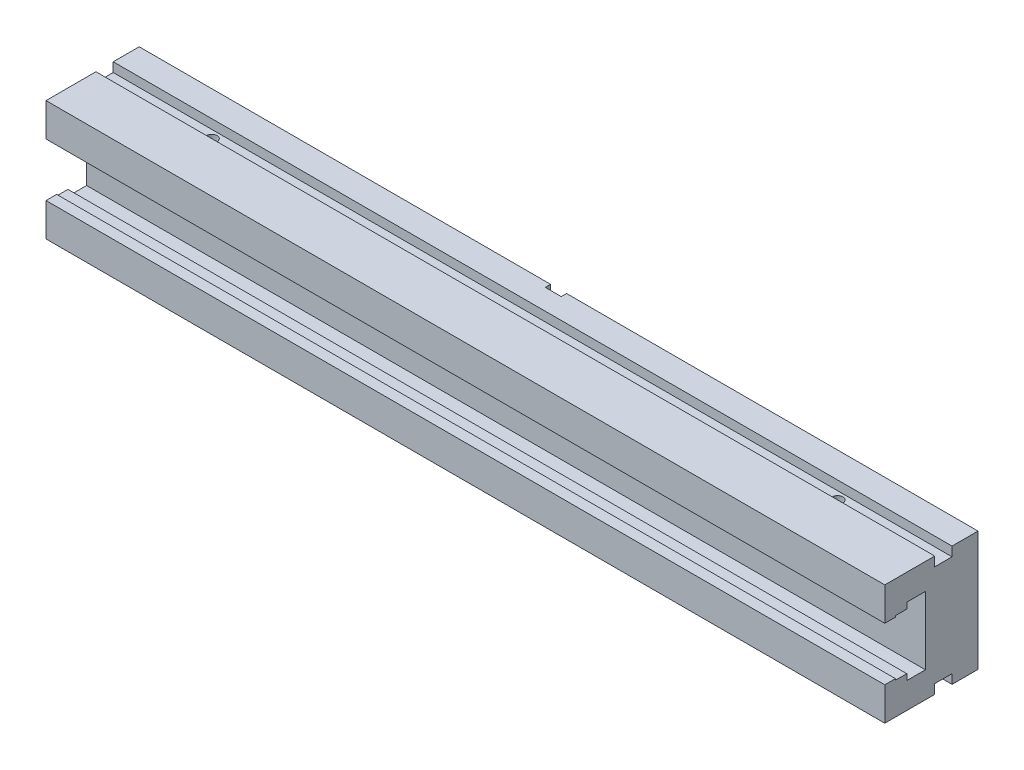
ISO-10303-21;
HEADER;
FILE_DESCRIPTION(('STEP AP214'),'2;1');
FILE_NAME('part.step','',(''),(''),'','','');
FILE_SCHEMA(('AUTOMOTIVE_DESIGN { 1 0 10303 214 1 1 1 1 }'));
ENDSEC;
DATA;
#1=APPLICATION_CONTEXT('core data for automotive mechanical design processes');
#2=APPLICATION_PROTOCOL_DEFINITION('international standard','automotive_design',2000,#1);
#3=PRODUCT_CONTEXT('',#1,'mechanical');
#4=PRODUCT('Part','Part','',(#3));
#5=PRODUCT_RELATED_PRODUCT_CATEGORY('part','',(#4));
#6=PRODUCT_DEFINITION_FORMATION('','',#4);
#7=PRODUCT_DEFINITION_CONTEXT('part definition',#1,'design');
#8=PRODUCT_DEFINITION('design','',#6,#7);
#9=PRODUCT_DEFINITION_SHAPE('','',#8);
#10=(LENGTH_UNIT() NAMED_UNIT(*) SI_UNIT(.MILLI.,.METRE.));
#11=(NAMED_UNIT(*) PLANE_ANGLE_UNIT() SI_UNIT($,.RADIAN.));
#12=(NAMED_UNIT(*) SI_UNIT($,.STERADIAN.) SOLID_ANGLE_UNIT());
#13=UNCERTAINTY_MEASURE_WITH_UNIT(LENGTH_MEASURE(1.E-05),#10,'distance_accuracy_value','');
#14=(GEOMETRIC_REPRESENTATION_CONTEXT(3) GLOBAL_UNCERTAINTY_ASSIGNED_CONTEXT((#13)) GLOBAL_UNIT_ASSIGNED_CONTEXT((#10,
#11,#12)) REPRESENTATION_CONTEXT('',''));
#15=CARTESIAN_POINT('',(0.,0.,0.));
#16=DIRECTION('',(0.,0.,1.));
#17=DIRECTION('',(1.,0.,0.));
#18=AXIS2_PLACEMENT_3D('',#15,#16,#17);
#19=CARTESIAN_POINT('',(315.,-45.,73.0585407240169));
#20=DIRECTION('',(0.,1.,0.));
#21=DIRECTION('',(0.,0.,1.));
#22=AXIS2_PLACEMENT_3D('',#19,#20,#21);
#23=PLANE('',#22);
#24=DIRECTION('',(0.,0.,-1.));
#25=VECTOR('',#24,1.);
#26=CARTESIAN_POINT('',(-315.,-45.,0.));
#27=LINE('',#26,#25);
#28=CARTESIAN_POINT('',(-315.,-45.,70.0001190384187));
#29=VERTEX_POINT('',#28);
#30=CARTESIAN_POINT('',(-315.,-45.,32.5));
#31=VERTEX_POINT('',#30);
#32=EDGE_CURVE('E340',#29,#31,#27,.T.);
#33=ORIENTED_EDGE('',*,*,#32,.T.);
#34=DIRECTION('',(-1.,0.,0.));
#35=VECTOR('',#34,1.);
#36=CARTESIAN_POINT('',(315.,-45.,32.5));
#37=LINE('',#36,#35);
#38=CARTESIAN_POINT('',(315.,-45.,32.5));
#39=VERTEX_POINT('',#38);
#40=EDGE_CURVE('E518',#39,#31,#37,.T.);
#41=ORIENTED_EDGE('',*,*,#40,.F.);
#42=DIRECTION('',(0.,0.,-1.));
#43=VECTOR('',#42,1.);
#44=CARTESIAN_POINT('',(315.,-45.,73.0585407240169));
#45=LINE('',#44,#43);
#46=CARTESIAN_POINT('',(315.,-45.,70.0001190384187));
#47=VERTEX_POINT('',#46);
#48=EDGE_CURVE('E533',#47,#39,#45,.T.);
#49=ORIENTED_EDGE('',*,*,#48,.F.);
#50=DIRECTION('',(1.,0.,0.));
#51=VECTOR('',#50,1.);
#52=CARTESIAN_POINT('',(315.,-45.,70.0001190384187));
#53=LINE('',#52,#51);
#54=EDGE_CURVE('E539',#29,#47,#53,.T.);
#55=ORIENTED_EDGE('',*,*,#54,.F.);
#56=EDGE_LOOP('',(#33,#41,#49,#55));
#57=FACE_BOUND('',#56,.T.);
#58=ADVANCED_FACE('F14',(#57),#23,.F.);
#59=CARTESIAN_POINT('',(315.,19.9992262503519,70.0001190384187));
#60=DIRECTION('',(0.,1.,0.));
#61=DIRECTION('',(0.,0.,1.));
#62=AXIS2_PLACEMENT_3D('',#59,#60,#61);
#63=PLANE('',#62);
#64=DIRECTION('',(0.,0.,-1.));
#65=VECTOR('',#64,1.);
#66=CARTESIAN_POINT('',(-315.,19.9992262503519,70.0001190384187));
#67=LINE('',#66,#65);
#68=CARTESIAN_POINT('',(-315.,19.9992262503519,70.0001190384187));
#69=VERTEX_POINT('',#68);
#70=CARTESIAN_POINT('',(-315.,19.9992262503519,62.0007380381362));
#71=VERTEX_POINT('',#70);
#72=EDGE_CURVE('E575',#69,#71,#67,.T.);
#73=ORIENTED_EDGE('',*,*,#72,.T.);
#74=DIRECTION('',(-1.,0.,0.));
#75=VECTOR('',#74,1.);
#76=CARTESIAN_POINT('',(315.,19.9992262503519,62.0007380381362));
#77=LINE('',#76,#75);
#78=CARTESIAN_POINT('',(315.,19.9992262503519,62.0007380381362));
#79=VERTEX_POINT('',#78);
#80=EDGE_CURVE('E336',#79,#71,#77,.T.);
#81=ORIENTED_EDGE('',*,*,#80,.F.);
#82=DIRECTION('',(0.,0.,-1.));
#83=VECTOR('',#82,1.);
#84=CARTESIAN_POINT('',(315.,19.9992262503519,70.0001190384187));
#85=LINE('',#84,#83);
#86=CARTESIAN_POINT('',(315.,19.9992262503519,70.0001190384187));
#87=VERTEX_POINT('',#86);
#88=EDGE_CURVE('E607',#87,#79,#85,.T.);
#89=ORIENTED_EDGE('',*,*,#88,.F.);
#90=DIRECTION('',(-1.,0.,0.));
#91=VECTOR('',#90,1.);
#92=CARTESIAN_POINT('',(315.,19.9992262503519,70.0001190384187));
#93=LINE('',#92,#91);
#94=EDGE_CURVE('E298',#87,#69,#93,.T.);
#95=ORIENTED_EDGE('',*,*,#94,.T.);
#96=EDGE_LOOP('',(#73,#81,#89,#95));
#97=FACE_BOUND('',#96,.T.);
#98=ADVANCED_FACE('F16',(#97),#63,.F.);
#99=CARTESIAN_POINT('',(315.,19.9992262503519,62.0007380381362));
#100=DIRECTION('',(0.,0.,1.));
#101=DIRECTION('',(1.,0.,0.));
#102=AXIS2_PLACEMENT_3D('',#99,#100,#101);
#103=PLANE('',#102);
#104=DIRECTION('',(0.,1.,0.));
#105=VECTOR('',#104,1.);
#106=CARTESIAN_POINT('',(-315.,19.9992262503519,62.0007380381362));
#107=LINE('',#106,#105);
#108=CARTESIAN_POINT('',(-315.,21.0003392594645,62.0007380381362));
#109=VERTEX_POINT('',#108);
#110=EDGE_CURVE('E578',#71,#109,#107,.T.);
#111=ORIENTED_EDGE('',*,*,#110,.T.);
#112=DIRECTION('',(-1.,0.,0.));
#113=VECTOR('',#112,1.);
#114=CARTESIAN_POINT('',(315.,21.0003392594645,62.0007380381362));
#115=LINE('',#114,#113);
#116=CARTESIAN_POINT('',(315.,21.0003392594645,62.0007380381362));
#117=VERTEX_POINT('',#116);
#118=EDGE_CURVE('E333',#117,#109,#115,.T.);
#119=ORIENTED_EDGE('',*,*,#118,.F.);
#120=DIRECTION('',(0.,1.,0.));
#121=VECTOR('',#120,1.);
#122=CARTESIAN_POINT('',(315.,19.9992262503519,62.0007380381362));
#123=LINE('',#122,#121);
#124=EDGE_CURVE('E610',#79,#117,#123,.T.);
#125=ORIENTED_EDGE('',*,*,#124,.F.);
#126=ORIENTED_EDGE('',*,*,#80,.T.);
#127=EDGE_LOOP('',(#111,#119,#125,#126));
#128=FACE_BOUND('',#127,.T.);
#129=ADVANCED_FACE('F700',(#128),#103,.F.);
#130=CARTESIAN_POINT('',(315.,21.0003392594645,53.5002053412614));
#131=DIRECTION('',(0.,1.,0.));
#132=DIRECTION('',(-1.,0.,0.));
#133=AXIS2_PLACEMENT_3D('',#130,#131,#132);
#134=PLANE('',#133);
#135=DIRECTION('',(0.,0.,-1.));
#136=VECTOR('',#135,1.);
#137=CARTESIAN_POINT('',(-315.,21.0003392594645,53.5002053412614));
#138=LINE('',#137,#136);
#139=CARTESIAN_POINT('',(-315.,21.0003392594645,53.5002053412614));
#140=VERTEX_POINT('',#139);
#141=EDGE_CURVE('E580',#109,#140,#138,.T.);
#142=ORIENTED_EDGE('',*,*,#141,.T.);
#143=DIRECTION('',(-1.,0.,0.));
#144=VECTOR('',#143,1.);
#145=CARTESIAN_POINT('',(315.,21.0003392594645,53.5002053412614));
#146=LINE('',#145,#144);
#147=CARTESIAN_POINT('',(315.,21.0003392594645,53.5002053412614));
#148=VERTEX_POINT('',#147);
#149=EDGE_CURVE('E330',#148,#140,#146,.T.);
#150=ORIENTED_EDGE('',*,*,#149,.F.);
#151=DIRECTION('',(0.,0.,-1.));
#152=VECTOR('',#151,1.);
#153=CARTESIAN_POINT('',(315.,21.0003392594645,53.5002053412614));
#154=LINE('',#153,#152);
#155=EDGE_CURVE('E612',#117,#148,#154,.T.);
#156=ORIENTED_EDGE('',*,*,#155,.F.);
#157=ORIENTED_EDGE('',*,*,#118,.T.);
#158=EDGE_LOOP('',(#142,#150,#156,#157));
#159=FACE_BOUND('',#158,.T.);
#160=ADVANCED_FACE('F796',(#159),#134,.F.);
#161=CARTESIAN_POINT('',(315.,21.0003392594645,53.5002053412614));
#162=DIRECTION('',(0.,0.,1.));
#163=DIRECTION('',(1.,0.,0.));
#164=AXIS2_PLACEMENT_3D('',#161,#162,#163);
#165=PLANE('',#164);
#166=DIRECTION('',(0.,1.,0.));
#167=VECTOR('',#166,1.);
#168=CARTESIAN_POINT('',(-315.,21.0003392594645,53.5002053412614));
#169=LINE('',#168,#167);
#170=CARTESIAN_POINT('',(-315.,25.4999910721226,53.5002053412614));
#171=VERTEX_POINT('',#170);
#172=EDGE_CURVE('E582',#140,#171,#169,.T.);
#173=ORIENTED_EDGE('',*,*,#172,.T.);
#174=DIRECTION('',(-1.,0.,0.));
#175=VECTOR('',#174,1.);
#176=CARTESIAN_POINT('',(315.,25.4999910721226,53.5002053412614));
#177=LINE('',#176,#175);
#178=CARTESIAN_POINT('',(315.,25.4999910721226,53.5002053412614));
#179=VERTEX_POINT('',#178);
#180=EDGE_CURVE('E327',#179,#171,#177,.T.);
#181=ORIENTED_EDGE('',*,*,#180,.F.);
#182=DIRECTION('',(0.,1.,0.));
#183=VECTOR('',#182,1.);
#184=CARTESIAN_POINT('',(315.,21.0003392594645,53.5002053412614));
#185=LINE('',#184,#183);
#186=EDGE_CURVE('E614',#148,#179,#185,.T.);
#187=ORIENTED_EDGE('',*,*,#186,.F.);
#188=ORIENTED_EDGE('',*,*,#149,.T.);
#189=EDGE_LOOP('',(#173,#181,#187,#188));
#190=FACE_BOUND('',#189,.T.);
#191=ADVANCED_FACE('F792',(#190),#165,.F.);
#192=CARTESIAN_POINT('',(315.,25.4999910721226,53.5002053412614));
#193=DIRECTION('',(0.,1.,0.));
#194=DIRECTION('',(-1.,0.,0.));
#195=AXIS2_PLACEMENT_3D('',#192,#193,#194);
#196=PLANE('',#195);
#197=DIRECTION('',(0.,0.,-1.));
#198=VECTOR('',#197,1.);
#199=CARTESIAN_POINT('',(-315.,25.4999910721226,53.5002053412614));
#200=LINE('',#199,#198);
#201=CARTESIAN_POINT('',(-315.,25.4999910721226,39.4999434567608));
#202=VERTEX_POINT('',#201);
#203=EDGE_CURVE('E584',#171,#202,#200,.T.);
#204=ORIENTED_EDGE('',*,*,#203,.T.);
#205=DIRECTION('',(-1.,0.,0.));
#206=VECTOR('',#205,1.);
#207=CARTESIAN_POINT('',(315.,25.4999910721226,39.4999434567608));
#208=LINE('',#207,#206);
#209=CARTESIAN_POINT('',(315.,25.4999910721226,39.4999434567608));
#210=VERTEX_POINT('',#209);
#211=EDGE_CURVE('E324',#210,#202,#208,.T.);
#212=ORIENTED_EDGE('',*,*,#211,.F.);
#213=DIRECTION('',(0.,0.,-1.));
#214=VECTOR('',#213,1.);
#215=CARTESIAN_POINT('',(315.,25.4999910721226,53.5002053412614));
#216=LINE('',#215,#214);
#217=EDGE_CURVE('E616',#179,#210,#216,.T.);
#218=ORIENTED_EDGE('',*,*,#217,.F.);
#219=ORIENTED_EDGE('',*,*,#180,.T.);
#220=EDGE_LOOP('',(#204,#212,#218,#219));
#221=FACE_BOUND('',#220,.T.);
#222=ADVANCED_FACE('F788',(#221),#196,.F.);
#223=CARTESIAN_POINT('',(315.,25.4999910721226,39.4999434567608));
#224=DIRECTION('',(0.,0.,-1.));
#225=DIRECTION('',(-1.,0.,0.));
#226=AXIS2_PLACEMENT_3D('',#223,#224,#225);
#227=PLANE('',#226);
#228=CARTESIAN_POINT('',(-200.,0.,39.4999434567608));
#229=DIRECTION('',(0.,0.,1.));
#230=DIRECTION('',(1.,0.,0.));
#231=AXIS2_PLACEMENT_3D('',#228,#229,#230);
#232=CIRCLE('',#231,9.5);
#233=CARTESIAN_POINT('',(-190.5,0.,39.4999434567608));
#234=VERTEX_POINT('',#233);
#235=EDGE_CURVE('E551',#234,#234,#232,.T.);
#236=ORIENTED_EDGE('',*,*,#235,.F.);
#237=EDGE_LOOP('',(#236));
#238=FACE_BOUND('',#237,.T.);
#239=CARTESIAN_POINT('',(200.,0.,39.4999434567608));
#240=DIRECTION('',(0.,0.,1.));
#241=DIRECTION('',(1.,0.,0.));
#242=AXIS2_PLACEMENT_3D('',#239,#240,#241);
#243=CIRCLE('',#242,9.5);
#244=CARTESIAN_POINT('',(209.5,0.,39.4999434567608));
#245=VERTEX_POINT('',#244);
#246=EDGE_CURVE('E563',#245,#245,#243,.T.);
#247=ORIENTED_EDGE('',*,*,#246,.F.);
#248=EDGE_LOOP('',(#247));
#249=FACE_BOUND('',#248,.T.);
#250=CARTESIAN_POINT('',(0.,0.,39.4999434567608));
#251=DIRECTION('',(0.,0.,1.));
#252=DIRECTION('',(1.,0.,0.));
#253=AXIS2_PLACEMENT_3D('',#250,#251,#252);
#254=CIRCLE('',#253,9.5);
#255=CARTESIAN_POINT('',(9.5,0.,39.4999434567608));
#256=VERTEX_POINT('',#255);
#257=EDGE_CURVE('E572',#256,#256,#254,.T.);
#258=ORIENTED_EDGE('',*,*,#257,.F.);
#259=EDGE_LOOP('',(#258));
#260=FACE_BOUND('',#259,.T.);
#261=DIRECTION('',(0.,-1.,0.));
#262=VECTOR('',#261,1.);
#263=CARTESIAN_POINT('',(-315.,25.4999910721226,39.4999434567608));
#264=LINE('',#263,#262);
#265=CARTESIAN_POINT('',(-315.,-25.4999910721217,39.4999434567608));
#266=VERTEX_POINT('',#265);
#267=EDGE_CURVE('E586',#202,#266,#264,.T.);
#268=ORIENTED_EDGE('',*,*,#267,.T.);
#269=DIRECTION('',(-1.,0.,0.));
#270=VECTOR('',#269,1.);
#271=CARTESIAN_POINT('',(315.,-25.4999910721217,39.4999434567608));
#272=LINE('',#271,#270);
#273=CARTESIAN_POINT('',(315.,-25.4999910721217,39.4999434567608));
#274=VERTEX_POINT('',#273);
#275=EDGE_CURVE('E321',#274,#266,#272,.T.);
#276=ORIENTED_EDGE('',*,*,#275,.F.);
#277=DIRECTION('',(0.,-1.,0.));
#278=VECTOR('',#277,1.);
#279=CARTESIAN_POINT('',(315.,25.4999910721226,39.4999434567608));
#280=LINE('',#279,#278);
#281=EDGE_CURVE('E618',#210,#274,#280,.T.);
#282=ORIENTED_EDGE('',*,*,#281,.F.);
#283=ORIENTED_EDGE('',*,*,#211,.T.);
#284=EDGE_LOOP('',(#268,#276,#282,#283));
#285=FACE_BOUND('',#284,.T.);
#286=ADVANCED_FACE('F784',(#238,#249,#260,#285),#227,.F.);
#287=CARTESIAN_POINT('',(315.,-25.4999910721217,39.4999434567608));
#288=DIRECTION('',(0.,-1.,0.));
#289=DIRECTION('',(1.,0.,0.));
#290=AXIS2_PLACEMENT_3D('',#287,#288,#289);
#291=PLANE('',#290);
#292=DIRECTION('',(0.,0.,1.));
#293=VECTOR('',#292,1.);
#294=CARTESIAN_POINT('',(-315.,-25.4999910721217,39.4999434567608));
#295=LINE('',#294,#293);
#296=CARTESIAN_POINT('',(-315.,-25.4999910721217,53.5002053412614));
#297=VERTEX_POINT('',#296);
#298=EDGE_CURVE('E588',#266,#297,#295,.T.);
#299=ORIENTED_EDGE('',*,*,#298,.T.);
#300=DIRECTION('',(-1.,0.,0.));
#301=VECTOR('',#300,1.);
#302=CARTESIAN_POINT('',(315.,-25.4999910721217,53.5002053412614));
#303=LINE('',#302,#301);
#304=CARTESIAN_POINT('',(315.,-25.4999910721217,53.5002053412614));
#305=VERTEX_POINT('',#304);
#306=EDGE_CURVE('E318',#305,#297,#303,.T.);
#307=ORIENTED_EDGE('',*,*,#306,.F.);
#308=DIRECTION('',(0.,0.,1.));
#309=VECTOR('',#308,1.);
#310=CARTESIAN_POINT('',(315.,-25.4999910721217,39.4999434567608));
#311=LINE('',#310,#309);
#312=EDGE_CURVE('E620',#274,#305,#311,.T.);
#313=ORIENTED_EDGE('',*,*,#312,.F.);
#314=ORIENTED_EDGE('',*,*,#275,.T.);
#315=EDGE_LOOP('',(#299,#307,#313,#314));
#316=FACE_BOUND('',#315,.T.);
#317=ADVANCED_FACE('F780',(#316),#291,.F.);
#318=CARTESIAN_POINT('',(315.,-25.4999910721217,53.5002053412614));
#319=DIRECTION('',(0.,0.,1.));
#320=DIRECTION('',(1.,0.,0.));
#321=AXIS2_PLACEMENT_3D('',#318,#319,#320);
#322=PLANE('',#321);
#323=DIRECTION('',(0.,1.,0.));
#324=VECTOR('',#323,1.);
#325=CARTESIAN_POINT('',(-315.,-25.4999910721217,53.5002053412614));
#326=LINE('',#325,#324);
#327=CARTESIAN_POINT('',(-315.,-21.0003392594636,53.5002053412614));
#328=VERTEX_POINT('',#327);
#329=EDGE_CURVE('E590',#297,#328,#326,.T.);
#330=ORIENTED_EDGE('',*,*,#329,.T.);
#331=DIRECTION('',(-1.,0.,0.));
#332=VECTOR('',#331,1.);
#333=CARTESIAN_POINT('',(315.,-21.0003392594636,53.5002053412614));
#334=LINE('',#333,#332);
#335=CARTESIAN_POINT('',(315.,-21.0003392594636,53.5002053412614));
#336=VERTEX_POINT('',#335);
#337=EDGE_CURVE('E315',#336,#328,#334,.T.);
#338=ORIENTED_EDGE('',*,*,#337,.F.);
#339=DIRECTION('',(0.,1.,0.));
#340=VECTOR('',#339,1.);
#341=CARTESIAN_POINT('',(315.,-25.4999910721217,53.5002053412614));
#342=LINE('',#341,#340);
#343=EDGE_CURVE('E622',#305,#336,#342,.T.);
#344=ORIENTED_EDGE('',*,*,#343,.F.);
#345=ORIENTED_EDGE('',*,*,#306,.T.);
#346=EDGE_LOOP('',(#330,#338,#344,#345));
#347=FACE_BOUND('',#346,.T.);
#348=ADVANCED_FACE('F776',(#347),#322,.F.);
#349=CARTESIAN_POINT('',(315.,-21.0003392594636,53.5002053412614));
#350=DIRECTION('',(0.,-1.,0.));
#351=DIRECTION('',(1.,0.,0.));
#352=AXIS2_PLACEMENT_3D('',#349,#350,#351);
#353=PLANE('',#352);
#354=DIRECTION('',(0.,0.,1.));
#355=VECTOR('',#354,1.);
#356=CARTESIAN_POINT('',(-315.,-21.0003392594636,53.5002053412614));
#357=LINE('',#356,#355);
#358=CARTESIAN_POINT('',(-315.,-21.0003392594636,62.0007380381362));
#359=VERTEX_POINT('',#358);
#360=EDGE_CURVE('E592',#328,#359,#357,.T.);
#361=ORIENTED_EDGE('',*,*,#360,.T.);
#362=DIRECTION('',(-1.,0.,0.));
#363=VECTOR('',#362,1.);
#364=CARTESIAN_POINT('',(315.,-21.0003392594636,62.0007380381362));
#365=LINE('',#364,#363);
#366=CARTESIAN_POINT('',(315.,-21.0003392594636,62.0007380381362));
#367=VERTEX_POINT('',#366);
#368=EDGE_CURVE('E312',#367,#359,#365,.T.);
#369=ORIENTED_EDGE('',*,*,#368,.F.);
#370=DIRECTION('',(0.,0.,1.));
#371=VECTOR('',#370,1.);
#372=CARTESIAN_POINT('',(315.,-21.0003392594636,53.5002053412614));
#373=LINE('',#372,#371);
#374=EDGE_CURVE('E624',#336,#367,#373,.T.);
#375=ORIENTED_EDGE('',*,*,#374,.F.);
#376=ORIENTED_EDGE('',*,*,#337,.T.);
#377=EDGE_LOOP('',(#361,#369,#375,#376));
#378=FACE_BOUND('',#377,.T.);
#379=ADVANCED_FACE('F772',(#378),#353,.F.);
#380=CARTESIAN_POINT('',(315.,-20.0004166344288,62.0007380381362));
#381=DIRECTION('',(0.,0.,1.));
#382=DIRECTION('',(1.,0.,0.));
#383=AXIS2_PLACEMENT_3D('',#380,#381,#382);
#384=PLANE('',#383);
#385=DIRECTION('',(0.,1.,0.));
#386=VECTOR('',#385,1.);
#387=CARTESIAN_POINT('',(-315.,-20.0004166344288,62.0007380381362));
#388=LINE('',#387,#386);
#389=CARTESIAN_POINT('',(-315.,-20.0004166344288,62.0007380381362));
#390=VERTEX_POINT('',#389);
#391=EDGE_CURVE('E594',#359,#390,#388,.T.);
#392=ORIENTED_EDGE('',*,*,#391,.T.);
#393=DIRECTION('',(-1.,0.,0.));
#394=VECTOR('',#393,1.);
#395=CARTESIAN_POINT('',(315.,-20.0004166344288,62.0007380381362));
#396=LINE('',#395,#394);
#397=CARTESIAN_POINT('',(315.,-20.0004166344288,62.0007380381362));
#398=VERTEX_POINT('',#397);
#399=EDGE_CURVE('E309',#398,#390,#396,.T.);
#400=ORIENTED_EDGE('',*,*,#399,.F.);
#401=DIRECTION('',(0.,1.,0.));
#402=VECTOR('',#401,1.);
#403=CARTESIAN_POINT('',(315.,-20.0004166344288,62.0007380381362));
#404=LINE('',#403,#402);
#405=EDGE_CURVE('E626',#367,#398,#404,.T.);
#406=ORIENTED_EDGE('',*,*,#405,.F.);
#407=ORIENTED_EDGE('',*,*,#368,.T.);
#408=EDGE_LOOP('',(#392,#400,#406,#407));
#409=FACE_BOUND('',#408,.T.);
#410=ADVANCED_FACE('F768',(#409),#384,.F.);
#411=CARTESIAN_POINT('',(315.,-20.0004166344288,62.0007380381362));
#412=DIRECTION('',(0.,-1.,0.));
#413=DIRECTION('',(1.,0.,0.));
#414=AXIS2_PLACEMENT_3D('',#411,#412,#413);
#415=PLANE('',#414);
#416=DIRECTION('',(0.,0.,1.));
#417=VECTOR('',#416,1.);
#418=CARTESIAN_POINT('',(-315.,-20.0004166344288,62.0007380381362));
#419=LINE('',#418,#417);
#420=CARTESIAN_POINT('',(-315.,-20.0004166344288,70.0001190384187));
#421=VERTEX_POINT('',#420);
#422=EDGE_CURVE('E596',#390,#421,#419,.T.);
#423=ORIENTED_EDGE('',*,*,#422,.T.);
#424=DIRECTION('',(-1.,0.,0.));
#425=VECTOR('',#424,1.);
#426=CARTESIAN_POINT('',(315.,-20.0004166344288,70.0001190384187));
#427=LINE('',#426,#425);
#428=CARTESIAN_POINT('',(315.,-20.0004166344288,70.0001190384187));
#429=VERTEX_POINT('',#428);
#430=EDGE_CURVE('E306',#429,#421,#427,.T.);
#431=ORIENTED_EDGE('',*,*,#430,.F.);
#432=DIRECTION('',(0.,0.,1.));
#433=VECTOR('',#432,1.);
#434=CARTESIAN_POINT('',(315.,-20.0004166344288,62.0007380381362));
#435=LINE('',#434,#433);
#436=EDGE_CURVE('E628',#398,#429,#435,.T.);
#437=ORIENTED_EDGE('',*,*,#436,.F.);
#438=ORIENTED_EDGE('',*,*,#399,.T.);
#439=EDGE_LOOP('',(#423,#431,#437,#438));
#440=FACE_BOUND('',#439,.T.);
#441=ADVANCED_FACE('F765',(#440),#415,.F.);
#442=CARTESIAN_POINT('',(315.,-45.0012499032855,70.0001190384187));
#443=DIRECTION('',(0.,0.,-1.));
#444=DIRECTION('',(-1.,0.,0.));
#445=AXIS2_PLACEMENT_3D('',#442,#443,#444);
#446=PLANE('',#445);
#447=DIRECTION('',(0.,-1.,0.));
#448=VECTOR('',#447,1.);
#449=CARTESIAN_POINT('',(-315.,-45.0012499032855,70.0001190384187));
#450=LINE('',#449,#448);
#451=EDGE_CURVE('E598',#421,#29,#450,.T.);
#452=ORIENTED_EDGE('',*,*,#451,.T.);
#453=ORIENTED_EDGE('',*,*,#54,.T.);
#454=DIRECTION('',(0.,-1.,0.));
#455=VECTOR('',#454,1.);
#456=CARTESIAN_POINT('',(315.,-45.0012499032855,70.0001190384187));
#457=LINE('',#456,#455);
#458=EDGE_CURVE('E300',#429,#47,#457,.T.);
#459=ORIENTED_EDGE('',*,*,#458,.F.);
#460=ORIENTED_EDGE('',*,*,#430,.T.);
#461=EDGE_LOOP('',(#452,#453,#459,#460));
#462=FACE_BOUND('',#461,.T.);
#463=ADVANCED_FACE('F634',(#462),#446,.F.);
#464=CARTESIAN_POINT('',(315.,45.0000595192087,0.));
#465=DIRECTION('',(0.,0.,1.));
#466=DIRECTION('',(1.,0.,0.));
#467=AXIS2_PLACEMENT_3D('',#464,#465,#466);
#468=PLANE('',#467);
#469=DIRECTION('',(1.,0.,0.));
#470=VECTOR('',#469,1.);
#471=CARTESIAN_POINT('',(220.,6.,0.));
#472=LINE('',#471,#470);
#473=CARTESIAN_POINT('',(220.,6.,0.));
#474=VERTEX_POINT('',#473);
#475=CARTESIAN_POINT('',(250.,6.,0.));
#476=VERTEX_POINT('',#475);
#477=EDGE_CURVE('E423',#474,#476,#472,.T.);
#478=ORIENTED_EDGE('',*,*,#477,.F.);
#479=CARTESIAN_POINT('',(220.,0.,0.));
#480=DIRECTION('',(0.,0.,-1.));
#481=DIRECTION('',(-1.,0.,0.));
#482=AXIS2_PLACEMENT_3D('',#479,#480,#481);
#483=CIRCLE('',#482,6.);
#484=CARTESIAN_POINT('',(220.,-6.,0.));
#485=VERTEX_POINT('',#484);
#486=EDGE_CURVE('E421',#485,#474,#483,.T.);
#487=ORIENTED_EDGE('',*,*,#486,.F.);
#488=DIRECTION('',(-1.,0.,0.));
#489=VECTOR('',#488,1.);
#490=CARTESIAN_POINT('',(220.,-6.,0.));
#491=LINE('',#490,#489);
#492=CARTESIAN_POINT('',(250.,-6.,0.));
#493=VERTEX_POINT('',#492);
#494=EDGE_CURVE('E411',#493,#485,#491,.T.);
#495=ORIENTED_EDGE('',*,*,#494,.F.);
#496=CARTESIAN_POINT('',(250.,0.,0.));
#497=DIRECTION('',(0.,0.,-1.));
#498=DIRECTION('',(-1.,0.,0.));
#499=AXIS2_PLACEMENT_3D('',#496,#497,#498);
#500=CIRCLE('',#499,6.);
#501=EDGE_CURVE('E427',#476,#493,#500,.T.);
#502=ORIENTED_EDGE('',*,*,#501,.F.);
#503=EDGE_LOOP('',(#478,#487,#495,#502));
#504=FACE_BOUND('',#503,.T.);
#505=DIRECTION('',(1.,0.,0.));
#506=VECTOR('',#505,1.);
#507=CARTESIAN_POINT('',(-250.,6.,0.));
#508=LINE('',#507,#506);
#509=CARTESIAN_POINT('',(-250.,6.,0.));
#510=VERTEX_POINT('',#509);
#511=CARTESIAN_POINT('',(-220.,6.,0.));
#512=VERTEX_POINT('',#511);
#513=EDGE_CURVE('E456',#510,#512,#508,.T.);
#514=ORIENTED_EDGE('',*,*,#513,.F.);
#515=CARTESIAN_POINT('',(-250.,0.,0.));
#516=DIRECTION('',(0.,0.,-1.));
#517=DIRECTION('',(-1.,0.,0.));
#518=AXIS2_PLACEMENT_3D('',#515,#516,#517);
#519=CIRCLE('',#518,6.);
#520=CARTESIAN_POINT('',(-250.,-6.,0.));
#521=VERTEX_POINT('',#520);
#522=EDGE_CURVE('E454',#521,#510,#519,.T.);
#523=ORIENTED_EDGE('',*,*,#522,.F.);
#524=DIRECTION('',(-1.,0.,0.));
#525=VECTOR('',#524,1.);
#526=CARTESIAN_POINT('',(-250.,-6.,0.));
#527=LINE('',#526,#525);
#528=CARTESIAN_POINT('',(-220.,-6.,0.));
#529=VERTEX_POINT('',#528);
#530=EDGE_CURVE('E444',#529,#521,#527,.T.);
#531=ORIENTED_EDGE('',*,*,#530,.F.);
#532=CARTESIAN_POINT('',(-220.,0.,0.));
#533=DIRECTION('',(0.,0.,-1.));
#534=DIRECTION('',(-1.,0.,0.));
#535=AXIS2_PLACEMENT_3D('',#532,#533,#534);
#536=CIRCLE('',#535,6.);
#537=EDGE_CURVE('E460',#512,#529,#536,.T.);
#538=ORIENTED_EDGE('',*,*,#537,.F.);
#539=EDGE_LOOP('',(#514,#523,#531,#538));
#540=FACE_BOUND('',#539,.T.);
#541=CARTESIAN_POINT('',(0.,0.,-4.27435864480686E-11));
#542=DIRECTION('',(0.,0.,1.));
#543=DIRECTION('',(1.,0.,0.));
#544=AXIS2_PLACEMENT_3D('',#541,#542,#543);
#545=CIRCLE('',#544,6.5);
#546=CARTESIAN_POINT('',(6.5,0.,-4.27435864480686E-11));
#547=VERTEX_POINT('',#546);
#548=EDGE_CURVE('E353',#547,#547,#545,.T.);
#549=ORIENTED_EDGE('',*,*,#548,.T.);
#550=EDGE_LOOP('',(#549));
#551=FACE_BOUND('',#550,.T.);
#552=CARTESIAN_POINT('',(200.,0.,-4.27435864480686E-11));
#553=DIRECTION('',(0.,0.,1.));
#554=DIRECTION('',(1.,0.,0.));
#555=AXIS2_PLACEMENT_3D('',#552,#553,#554);
#556=CIRCLE('',#555,6.5);
#557=CARTESIAN_POINT('',(206.5,0.,-4.27435864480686E-11));
#558=VERTEX_POINT('',#557);
#559=EDGE_CURVE('E554',#558,#558,#556,.T.);
#560=ORIENTED_EDGE('',*,*,#559,.T.);
#561=EDGE_LOOP('',(#560));
#562=FACE_BOUND('',#561,.T.);
#563=CARTESIAN_POINT('',(-200.,0.,-4.27435864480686E-11));
#564=DIRECTION('',(0.,0.,1.));
#565=DIRECTION('',(1.,0.,0.));
#566=AXIS2_PLACEMENT_3D('',#563,#564,#565);
#567=CIRCLE('',#566,6.5);
#568=CARTESIAN_POINT('',(-193.5,0.,-4.27435864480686E-11));
#569=VERTEX_POINT('',#568);
#570=EDGE_CURVE('E542',#569,#569,#567,.T.);
#571=ORIENTED_EDGE('',*,*,#570,.T.);
#572=EDGE_LOOP('',(#571));
#573=FACE_BOUND('',#572,.T.);
#574=DIRECTION('',(0.,1.,0.));
#575=VECTOR('',#574,1.);
#576=CARTESIAN_POINT('',(-315.,45.0000595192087,0.));
#577=LINE('',#576,#575);
#578=CARTESIAN_POINT('',(-315.,-45.,0.));
#579=VERTEX_POINT('',#578);
#580=CARTESIAN_POINT('',(-315.,45.,0.));
#581=VERTEX_POINT('',#580);
#582=EDGE_CURVE('E601',#579,#581,#577,.T.);
#583=ORIENTED_EDGE('',*,*,#582,.T.);
#584=DIRECTION('',(1.,0.,0.));
#585=VECTOR('',#584,1.);
#586=CARTESIAN_POINT('',(315.,45.,0.));
#587=LINE('',#586,#585);
#588=CARTESIAN_POINT('',(-6.,45.,0.));
#589=VERTEX_POINT('',#588);
#590=EDGE_CURVE('E660',#581,#589,#587,.T.);
#591=ORIENTED_EDGE('',*,*,#590,.T.);
#592=DIRECTION('',(0.,1.,0.));
#593=VECTOR('',#592,1.);
#594=CARTESIAN_POINT('',(-6.,17.5,0.));
#595=LINE('',#594,#593);
#596=CARTESIAN_POINT('',(-6.,17.5,0.));
#597=VERTEX_POINT('',#596);
#598=EDGE_CURVE('E485',#597,#589,#595,.T.);
#599=ORIENTED_EDGE('',*,*,#598,.F.);
#600=CARTESIAN_POINT('',(0.,17.5,0.));
#601=DIRECTION('',(0.,0.,-1.));
#602=DIRECTION('',(-1.,0.,0.));
#603=AXIS2_PLACEMENT_3D('',#600,#601,#602);
#604=CIRCLE('',#603,6.);
#605=CARTESIAN_POINT('',(6.,17.5,0.));
#606=VERTEX_POINT('',#605);
#607=EDGE_CURVE('E370',#606,#597,#604,.T.);
#608=ORIENTED_EDGE('',*,*,#607,.F.);
#609=DIRECTION('',(0.,-1.,0.));
#610=VECTOR('',#609,1.);
#611=CARTESIAN_POINT('',(6.,17.5,0.));
#612=LINE('',#611,#610);
#613=CARTESIAN_POINT('',(6.,45.,0.));
#614=VERTEX_POINT('',#613);
#615=EDGE_CURVE('E477',#614,#606,#612,.T.);
#616=ORIENTED_EDGE('',*,*,#615,.F.);
#617=CARTESIAN_POINT('',(315.,45.,0.));
#618=VERTEX_POINT('',#617);
#619=EDGE_CURVE('E658',#614,#618,#587,.T.);
#620=ORIENTED_EDGE('',*,*,#619,.T.);
#621=DIRECTION('',(0.,1.,0.));
#622=VECTOR('',#621,1.);
#623=CARTESIAN_POINT('',(315.,45.0000595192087,0.));
#624=LINE('',#623,#622);
#625=CARTESIAN_POINT('',(315.,-45.,0.));
#626=VERTEX_POINT('',#625);
#627=EDGE_CURVE('E289',#626,#618,#624,.T.);
#628=ORIENTED_EDGE('',*,*,#627,.F.);
#629=DIRECTION('',(-1.,0.,0.));
#630=VECTOR('',#629,1.);
#631=CARTESIAN_POINT('',(315.,-45.,0.));
#632=LINE('',#631,#630);
#633=CARTESIAN_POINT('',(6.,-45.,0.));
#634=VERTEX_POINT('',#633);
#635=EDGE_CURVE('E536',#626,#634,#632,.T.);
#636=ORIENTED_EDGE('',*,*,#635,.T.);
#637=DIRECTION('',(0.,-1.,0.));
#638=VECTOR('',#637,1.);
#639=CARTESIAN_POINT('',(6.,-17.5,0.));
#640=LINE('',#639,#638);
#641=CARTESIAN_POINT('',(6.,-17.5,0.));
#642=VERTEX_POINT('',#641);
#643=EDGE_CURVE('E396',#642,#634,#640,.T.);
#644=ORIENTED_EDGE('',*,*,#643,.F.);
#645=CARTESIAN_POINT('',(0.,-17.5,0.));
#646=DIRECTION('',(0.,0.,-1.));
#647=DIRECTION('',(-1.,0.,0.));
#648=AXIS2_PLACEMENT_3D('',#645,#646,#647);
#649=CIRCLE('',#648,6.);
#650=CARTESIAN_POINT('',(-6.,-17.5,0.));
#651=VERTEX_POINT('',#650);
#652=EDGE_CURVE('E394',#651,#642,#649,.T.);
#653=ORIENTED_EDGE('',*,*,#652,.F.);
#654=DIRECTION('',(0.,1.,0.));
#655=VECTOR('',#654,1.);
#656=CARTESIAN_POINT('',(-6.,-17.5,0.));
#657=LINE('',#656,#655);
#658=CARTESIAN_POINT('',(-6.,-45.,0.));
#659=VERTEX_POINT('',#658);
#660=EDGE_CURVE('E385',#659,#651,#657,.T.);
#661=ORIENTED_EDGE('',*,*,#660,.F.);
#662=EDGE_CURVE('E379',#659,#579,#632,.T.);
#663=ORIENTED_EDGE('',*,*,#662,.T.);
#664=EDGE_LOOP('',(#583,#591,#599,#608,#616,#620,#628,#636,#644,#653,#661,#663));
#665=FACE_BOUND('',#664,.T.);
#666=ADVANCED_FACE('F391',(#504,#540,#551,#562,#573,#665),#468,.F.);
#667=CARTESIAN_POINT('',(315.,45.0000595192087,19.5));
#668=DIRECTION('',(0.,0.,-1.));
#669=DIRECTION('',(-1.,0.,0.));
#670=AXIS2_PLACEMENT_3D('',#667,#668,#669);
#671=PLANE('',#670);
#672=DIRECTION('',(0.,-1.,0.));
#673=VECTOR('',#672,1.);
#674=CARTESIAN_POINT('',(315.,45.0000595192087,19.5));
#675=LINE('',#674,#673);
#676=CARTESIAN_POINT('',(315.,45.,19.5));
#677=VERTEX_POINT('',#676);
#678=CARTESIAN_POINT('',(315.,38.,19.5));
#679=VERTEX_POINT('',#678);
#680=EDGE_CURVE('E286',#677,#679,#675,.T.);
#681=ORIENTED_EDGE('',*,*,#680,.F.);
#682=DIRECTION('',(-1.,0.,0.));
#683=VECTOR('',#682,1.);
#684=CARTESIAN_POINT('',(315.,45.,19.5));
#685=LINE('',#684,#683);
#686=CARTESIAN_POINT('',(-315.,45.,19.5));
#687=VERTEX_POINT('',#686);
#688=EDGE_CURVE('E269',#677,#687,#685,.T.);
#689=ORIENTED_EDGE('',*,*,#688,.T.);
#690=DIRECTION('',(0.,-1.,0.));
#691=VECTOR('',#690,1.);
#692=CARTESIAN_POINT('',(-315.,45.0000595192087,19.5));
#693=LINE('',#692,#691);
#694=CARTESIAN_POINT('',(-315.,38.,19.5));
#695=VERTEX_POINT('',#694);
#696=EDGE_CURVE('E603',#687,#695,#693,.T.);
#697=ORIENTED_EDGE('',*,*,#696,.T.);
#698=DIRECTION('',(-1.,0.,0.));
#699=VECTOR('',#698,1.);
#700=CARTESIAN_POINT('',(315.,38.,19.5));
#701=LINE('',#700,#699);
#702=EDGE_CURVE('E279',#679,#695,#701,.T.);
#703=ORIENTED_EDGE('',*,*,#702,.F.);
#704=EDGE_LOOP('',(#681,#689,#697,#703));
#705=FACE_BOUND('',#704,.T.);
#706=ADVANCED_FACE('F293',(#705),#671,.F.);
#707=CARTESIAN_POINT('',(315.,19.9992262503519,70.0001190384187));
#708=DIRECTION('',(0.,0.,-1.));
#709=DIRECTION('',(-1.,0.,0.));
#710=AXIS2_PLACEMENT_3D('',#707,#708,#709);
#711=PLANE('',#710);
#712=DIRECTION('',(0.,-1.,0.));
#713=VECTOR('',#712,1.);
#714=CARTESIAN_POINT('',(315.,19.9992262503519,70.0001190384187));
#715=LINE('',#714,#713);
#716=CARTESIAN_POINT('',(315.,45.,70.0001190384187));
#717=VERTEX_POINT('',#716);
#718=EDGE_CURVE('E296',#717,#87,#715,.T.);
#719=ORIENTED_EDGE('',*,*,#718,.F.);
#720=DIRECTION('',(-1.,0.,0.));
#721=VECTOR('',#720,1.);
#722=CARTESIAN_POINT('',(315.,45.,70.0001190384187));
#723=LINE('',#722,#721);
#724=CARTESIAN_POINT('',(-315.,45.,70.0001190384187));
#725=VERTEX_POINT('',#724);
#726=EDGE_CURVE('E457',#717,#725,#723,.T.);
#727=ORIENTED_EDGE('',*,*,#726,.T.);
#728=DIRECTION('',(0.,-1.,0.));
#729=VECTOR('',#728,1.);
#730=CARTESIAN_POINT('',(-315.,19.9992262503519,70.0001190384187));
#731=LINE('',#730,#729);
#732=EDGE_CURVE('E605',#725,#69,#731,.T.);
#733=ORIENTED_EDGE('',*,*,#732,.T.);
#734=ORIENTED_EDGE('',*,*,#94,.F.);
#735=EDGE_LOOP('',(#719,#727,#733,#734));
#736=FACE_BOUND('',#735,.T.);
#737=ADVANCED_FACE('F754',(#736),#711,.F.);
#738=CARTESIAN_POINT('',(315.,19.9992262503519,0.));
#739=DIRECTION('',(-1.,0.,0.));
#740=DIRECTION('',(0.,-1.,0.));
#741=AXIS2_PLACEMENT_3D('',#738,#739,#740);
#742=PLANE('',#741);
#743=DIRECTION('',(0.,-1.,0.));
#744=VECTOR('',#743,1.);
#745=CARTESIAN_POINT('',(315.,45.0000595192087,32.5));
#746=LINE('',#745,#744);
#747=CARTESIAN_POINT('',(315.,45.,32.5));
#748=VERTEX_POINT('',#747);
#749=CARTESIAN_POINT('',(315.,38.,32.5));
#750=VERTEX_POINT('',#749);
#751=EDGE_CURVE('E529',#748,#750,#746,.T.);
#752=ORIENTED_EDGE('',*,*,#751,.F.);
#753=DIRECTION('',(0.,0.,1.));
#754=VECTOR('',#753,1.);
#755=CARTESIAN_POINT('',(315.,45.,77.3087976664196));
#756=LINE('',#755,#754);
#757=EDGE_CURVE('E30',#748,#717,#756,.T.);
#758=ORIENTED_EDGE('',*,*,#757,.T.);
#759=ORIENTED_EDGE('',*,*,#718,.T.);
#760=ORIENTED_EDGE('',*,*,#88,.T.);
#761=ORIENTED_EDGE('',*,*,#124,.T.);
#762=ORIENTED_EDGE('',*,*,#155,.T.);
#763=ORIENTED_EDGE('',*,*,#186,.T.);
#764=ORIENTED_EDGE('',*,*,#217,.T.);
#765=ORIENTED_EDGE('',*,*,#281,.T.);
#766=ORIENTED_EDGE('',*,*,#312,.T.);
#767=ORIENTED_EDGE('',*,*,#343,.T.);
#768=ORIENTED_EDGE('',*,*,#374,.T.);
#769=ORIENTED_EDGE('',*,*,#405,.T.);
#770=ORIENTED_EDGE('',*,*,#436,.T.);
#771=ORIENTED_EDGE('',*,*,#458,.T.);
#772=ORIENTED_EDGE('',*,*,#48,.T.);
#773=DIRECTION('',(0.,1.,0.));
#774=VECTOR('',#773,1.);
#775=CARTESIAN_POINT('',(315.,-38.,32.5));
#776=LINE('',#775,#774);
#777=CARTESIAN_POINT('',(315.,-38.,32.5));
#778=VERTEX_POINT('',#777);
#779=EDGE_CURVE('E510',#39,#778,#776,.T.);
#780=ORIENTED_EDGE('',*,*,#779,.T.);
#781=DIRECTION('',(0.,0.,-1.));
#782=VECTOR('',#781,1.);
#783=CARTESIAN_POINT('',(315.,-38.,19.5));
#784=LINE('',#783,#782);
#785=CARTESIAN_POINT('',(315.,-38.,19.5));
#786=VERTEX_POINT('',#785);
#787=EDGE_CURVE('E349',#778,#786,#784,.T.);
#788=ORIENTED_EDGE('',*,*,#787,.T.);
#789=DIRECTION('',(0.,-1.,0.));
#790=VECTOR('',#789,1.);
#791=CARTESIAN_POINT('',(315.,-38.,19.5));
#792=LINE('',#791,#790);
#793=CARTESIAN_POINT('',(315.,-45.,19.5));
#794=VERTEX_POINT('',#793);
#795=EDGE_CURVE('E507',#786,#794,#792,.T.);
#796=ORIENTED_EDGE('',*,*,#795,.T.);
#797=EDGE_CURVE('E531',#794,#626,#45,.T.);
#798=ORIENTED_EDGE('',*,*,#797,.T.);
#799=ORIENTED_EDGE('',*,*,#627,.T.);
#800=DIRECTION('',(0.,0.,1.));
#801=VECTOR('',#800,1.);
#802=CARTESIAN_POINT('',(315.,45.,19.5));
#803=LINE('',#802,#801);
#804=EDGE_CURVE('E272',#618,#677,#803,.T.);
#805=ORIENTED_EDGE('',*,*,#804,.T.);
#806=ORIENTED_EDGE('',*,*,#680,.T.);
#807=DIRECTION('',(0.,0.,1.));
#808=VECTOR('',#807,1.);
#809=CARTESIAN_POINT('',(315.,38.,32.5));
#810=LINE('',#809,#808);
#811=EDGE_CURVE('E290',#679,#750,#810,.T.);
#812=ORIENTED_EDGE('',*,*,#811,.T.);
#813=EDGE_LOOP('',(#752,#758,#759,#760,#761,#762,#763,#764,#765,#766,#767,#768,#769,#770,#771,
#772,#780,#788,#796,#798,#799,#805,#806,#812));
#814=FACE_BOUND('',#813,.T.);
#815=ADVANCED_FACE('F284',(#814),#742,.F.);
#816=CARTESIAN_POINT('',(-315.,19.9992262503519,0.));
#817=DIRECTION('',(-1.,0.,0.));
#818=DIRECTION('',(0.,-1.,0.));
#819=AXIS2_PLACEMENT_3D('',#816,#817,#818);
#820=PLANE('',#819);
#821=DIRECTION('',(0.,0.,1.));
#822=VECTOR('',#821,1.);
#823=CARTESIAN_POINT('',(-315.,45.,77.3087976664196));
#824=LINE('',#823,#822);
#825=CARTESIAN_POINT('',(-315.,45.,32.5));
#826=VERTEX_POINT('',#825);
#827=EDGE_CURVE('E291',#826,#725,#824,.T.);
#828=ORIENTED_EDGE('',*,*,#827,.F.);
#829=DIRECTION('',(0.,-1.,0.));
#830=VECTOR('',#829,1.);
#831=CARTESIAN_POINT('',(-315.,45.0000595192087,32.5));
#832=LINE('',#831,#830);
#833=CARTESIAN_POINT('',(-315.,38.,32.5));
#834=VERTEX_POINT('',#833);
#835=EDGE_CURVE('E528',#826,#834,#832,.T.);
#836=ORIENTED_EDGE('',*,*,#835,.T.);
#837=DIRECTION('',(0.,0.,1.));
#838=VECTOR('',#837,1.);
#839=CARTESIAN_POINT('',(-315.,38.,32.5));
#840=LINE('',#839,#838);
#841=EDGE_CURVE('E830',#695,#834,#840,.T.);
#842=ORIENTED_EDGE('',*,*,#841,.F.);
#843=ORIENTED_EDGE('',*,*,#696,.F.);
#844=DIRECTION('',(0.,0.,1.));
#845=VECTOR('',#844,1.);
#846=CARTESIAN_POINT('',(-315.,45.,19.5));
#847=LINE('',#846,#845);
#848=EDGE_CURVE('E275',#581,#687,#847,.T.);
#849=ORIENTED_EDGE('',*,*,#848,.F.);
#850=ORIENTED_EDGE('',*,*,#582,.F.);
#851=CARTESIAN_POINT('',(-315.,-45.,19.5));
#852=VERTEX_POINT('',#851);
#853=EDGE_CURVE('E339',#852,#579,#27,.T.);
#854=ORIENTED_EDGE('',*,*,#853,.F.);
#855=DIRECTION('',(0.,-1.,0.));
#856=VECTOR('',#855,1.);
#857=CARTESIAN_POINT('',(-315.,19.9992262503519,19.5));
#858=LINE('',#857,#856);
#859=CARTESIAN_POINT('',(-315.,-38.,19.5));
#860=VERTEX_POINT('',#859);
#861=EDGE_CURVE('E517',#860,#852,#858,.T.);
#862=ORIENTED_EDGE('',*,*,#861,.F.);
#863=DIRECTION('',(0.,0.,-1.));
#864=VECTOR('',#863,1.);
#865=CARTESIAN_POINT('',(-315.,-38.,0.));
#866=LINE('',#865,#864);
#867=CARTESIAN_POINT('',(-315.,-38.,32.5));
#868=VERTEX_POINT('',#867);
#869=EDGE_CURVE('E343',#868,#860,#866,.T.);
#870=ORIENTED_EDGE('',*,*,#869,.F.);
#871=DIRECTION('',(0.,1.,0.));
#872=VECTOR('',#871,1.);
#873=CARTESIAN_POINT('',(-315.,19.9992262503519,32.5));
#874=LINE('',#873,#872);
#875=EDGE_CURVE('E526',#31,#868,#874,.T.);
#876=ORIENTED_EDGE('',*,*,#875,.F.);
#877=ORIENTED_EDGE('',*,*,#32,.F.);
#878=ORIENTED_EDGE('',*,*,#451,.F.);
#879=ORIENTED_EDGE('',*,*,#422,.F.);
#880=ORIENTED_EDGE('',*,*,#391,.F.);
#881=ORIENTED_EDGE('',*,*,#360,.F.);
#882=ORIENTED_EDGE('',*,*,#329,.F.);
#883=ORIENTED_EDGE('',*,*,#298,.F.);
#884=ORIENTED_EDGE('',*,*,#267,.F.);
#885=ORIENTED_EDGE('',*,*,#203,.F.);
#886=ORIENTED_EDGE('',*,*,#172,.F.);
#887=ORIENTED_EDGE('',*,*,#141,.F.);
#888=ORIENTED_EDGE('',*,*,#110,.F.);
#889=ORIENTED_EDGE('',*,*,#72,.F.);
#890=ORIENTED_EDGE('',*,*,#732,.F.);
#891=EDGE_LOOP('',(#828,#836,#842,#843,#849,#850,#854,#862,#870,#876,#877,#878,#879,#880,#881,
#882,#883,#884,#885,#886,#887,#888,#889,#890));
#892=FACE_BOUND('',#891,.T.);
#893=ADVANCED_FACE('F642',(#892),#820,.T.);
#894=CARTESIAN_POINT('',(0.,0.,39.4999434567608));
#895=DIRECTION('',(0.,0.,1.));
#896=DIRECTION('',(1.,0.,0.));
#897=AXIS2_PLACEMENT_3D('',#894,#895,#896);
#898=CYLINDRICAL_SURFACE('',#897,6.5);
#899=CARTESIAN_POINT('',(0.,0.,26.4999434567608));
#900=DIRECTION('',(0.,0.,1.));
#901=DIRECTION('',(1.,0.,0.));
#902=AXIS2_PLACEMENT_3D('',#899,#900,#901);
#903=CIRCLE('',#902,6.5);
#904=CARTESIAN_POINT('',(6.5,0.,26.4999434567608));
#905=VERTEX_POINT('',#904);
#906=EDGE_CURVE('E566',#905,#905,#903,.T.);
#907=ORIENTED_EDGE('',*,*,#906,.T.);
#908=EDGE_LOOP('',(#907));
#909=FACE_BOUND('',#908,.T.);
#910=ORIENTED_EDGE('',*,*,#548,.F.);
#911=EDGE_LOOP('',(#910));
#912=FACE_BOUND('',#911,.T.);
#913=ADVANCED_FACE('F739',(#909,#912),#898,.F.);
#914=CARTESIAN_POINT('',(0.,0.,39.4999434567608));
#915=DIRECTION('',(0.,0.,1.));
#916=DIRECTION('',(1.,0.,0.));
#917=AXIS2_PLACEMENT_3D('',#914,#915,#916);
#918=CYLINDRICAL_SURFACE('',#917,9.5);
#919=CARTESIAN_POINT('',(0.,0.,26.4999434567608));
#920=DIRECTION('',(0.,0.,1.));
#921=DIRECTION('',(1.,0.,0.));
#922=AXIS2_PLACEMENT_3D('',#919,#920,#921);
#923=CIRCLE('',#922,9.5);
#924=CARTESIAN_POINT('',(9.5,0.,26.4999434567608));
#925=VERTEX_POINT('',#924);
#926=EDGE_CURVE('E569',#925,#925,#923,.T.);
#927=ORIENTED_EDGE('',*,*,#926,.F.);
#928=EDGE_LOOP('',(#927));
#929=FACE_BOUND('',#928,.T.);
#930=ORIENTED_EDGE('',*,*,#257,.T.);
#931=EDGE_LOOP('',(#930));
#932=FACE_BOUND('',#931,.T.);
#933=ADVANCED_FACE('F742',(#929,#932),#918,.F.);
#934=CARTESIAN_POINT('',(0.,6.5,26.4999434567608));
#935=DIRECTION('',(0.,0.,-1.));
#936=DIRECTION('',(-1.,0.,0.));
#937=AXIS2_PLACEMENT_3D('',#934,#935,#936);
#938=PLANE('',#937);
#939=ORIENTED_EDGE('',*,*,#906,.F.);
#940=EDGE_LOOP('',(#939));
#941=FACE_BOUND('',#940,.T.);
#942=ORIENTED_EDGE('',*,*,#926,.T.);
#943=EDGE_LOOP('',(#942));
#944=FACE_BOUND('',#943,.T.);
#945=ADVANCED_FACE('F730',(#941,#944),#938,.F.);
#946=CARTESIAN_POINT('',(200.,0.,39.4999434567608));
#947=DIRECTION('',(0.,0.,1.));
#948=DIRECTION('',(1.,0.,0.));
#949=AXIS2_PLACEMENT_3D('',#946,#947,#948);
#950=CYLINDRICAL_SURFACE('',#949,6.5);
#951=CARTESIAN_POINT('',(200.,0.,26.4999434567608));
#952=DIRECTION('',(0.,0.,1.));
#953=DIRECTION('',(1.,0.,0.));
#954=AXIS2_PLACEMENT_3D('',#951,#952,#953);
#955=CIRCLE('',#954,6.5);
#956=CARTESIAN_POINT('',(206.5,0.,26.4999434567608));
#957=VERTEX_POINT('',#956);
#958=EDGE_CURVE('E557',#957,#957,#955,.T.);
#959=ORIENTED_EDGE('',*,*,#958,.T.);
#960=EDGE_LOOP('',(#959));
#961=FACE_BOUND('',#960,.T.);
#962=ORIENTED_EDGE('',*,*,#559,.F.);
#963=EDGE_LOOP('',(#962));
#964=FACE_BOUND('',#963,.T.);
#965=ADVANCED_FACE('F726',(#961,#964),#950,.F.);
#966=CARTESIAN_POINT('',(200.,0.,39.4999434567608));
#967=DIRECTION('',(0.,0.,1.));
#968=DIRECTION('',(1.,0.,0.));
#969=AXIS2_PLACEMENT_3D('',#966,#967,#968);
#970=CYLINDRICAL_SURFACE('',#969,9.5);
#971=CARTESIAN_POINT('',(200.,0.,26.4999434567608));
#972=DIRECTION('',(0.,0.,1.));
#973=DIRECTION('',(1.,0.,0.));
#974=AXIS2_PLACEMENT_3D('',#971,#972,#973);
#975=CIRCLE('',#974,9.5);
#976=CARTESIAN_POINT('',(209.5,0.,26.4999434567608));
#977=VERTEX_POINT('',#976);
#978=EDGE_CURVE('E560',#977,#977,#975,.T.);
#979=ORIENTED_EDGE('',*,*,#978,.F.);
#980=EDGE_LOOP('',(#979));
#981=FACE_BOUND('',#980,.T.);
#982=ORIENTED_EDGE('',*,*,#246,.T.);
#983=EDGE_LOOP('',(#982));
#984=FACE_BOUND('',#983,.T.);
#985=ADVANCED_FACE('F729',(#981,#984),#970,.F.);
#986=CARTESIAN_POINT('',(200.,6.5,26.4999434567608));
#987=DIRECTION('',(0.,0.,-1.));
#988=DIRECTION('',(-1.,0.,0.));
#989=AXIS2_PLACEMENT_3D('',#986,#987,#988);
#990=PLANE('',#989);
#991=ORIENTED_EDGE('',*,*,#958,.F.);
#992=EDGE_LOOP('',(#991));
#993=FACE_BOUND('',#992,.T.);
#994=ORIENTED_EDGE('',*,*,#978,.T.);
#995=EDGE_LOOP('',(#994));
#996=FACE_BOUND('',#995,.T.);
#997=ADVANCED_FACE('F732',(#993,#996),#990,.F.);
#998=CARTESIAN_POINT('',(-200.,0.,39.4999434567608));
#999=DIRECTION('',(0.,0.,1.));
#1000=DIRECTION('',(1.,0.,0.));
#1001=AXIS2_PLACEMENT_3D('',#998,#999,#1000);
#1002=CYLINDRICAL_SURFACE('',#1001,6.5);
#1003=CARTESIAN_POINT('',(-200.,0.,26.4999434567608));
#1004=DIRECTION('',(0.,0.,1.));
#1005=DIRECTION('',(1.,0.,0.));
#1006=AXIS2_PLACEMENT_3D('',#1003,#1004,#1005);
#1007=CIRCLE('',#1006,6.5);
#1008=CARTESIAN_POINT('',(-193.5,0.,26.4999434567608));
#1009=VERTEX_POINT('',#1008);
#1010=EDGE_CURVE('E545',#1009,#1009,#1007,.T.);
#1011=ORIENTED_EDGE('',*,*,#1010,.T.);
#1012=EDGE_LOOP('',(#1011));
#1013=FACE_BOUND('',#1012,.T.);
#1014=ORIENTED_EDGE('',*,*,#570,.F.);
#1015=EDGE_LOOP('',(#1014));
#1016=FACE_BOUND('',#1015,.T.);
#1017=ADVANCED_FACE('F720',(#1013,#1016),#1002,.F.);
#1018=CARTESIAN_POINT('',(-200.,0.,39.4999434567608));
#1019=DIRECTION('',(0.,0.,1.));
#1020=DIRECTION('',(1.,0.,0.));
#1021=AXIS2_PLACEMENT_3D('',#1018,#1019,#1020);
#1022=CYLINDRICAL_SURFACE('',#1021,9.5);
#1023=CARTESIAN_POINT('',(-200.,0.,26.4999434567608));
#1024=DIRECTION('',(0.,0.,1.));
#1025=DIRECTION('',(1.,0.,0.));
#1026=AXIS2_PLACEMENT_3D('',#1023,#1024,#1025);
#1027=CIRCLE('',#1026,9.5);
#1028=CARTESIAN_POINT('',(-190.5,0.,26.4999434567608));
#1029=VERTEX_POINT('',#1028);
#1030=EDGE_CURVE('E548',#1029,#1029,#1027,.T.);
#1031=ORIENTED_EDGE('',*,*,#1030,.F.);
#1032=EDGE_LOOP('',(#1031));
#1033=FACE_BOUND('',#1032,.T.);
#1034=ORIENTED_EDGE('',*,*,#235,.T.);
#1035=EDGE_LOOP('',(#1034));
#1036=FACE_BOUND('',#1035,.T.);
#1037=ADVANCED_FACE('F713',(#1033,#1036),#1022,.F.);
#1038=CARTESIAN_POINT('',(-200.,6.5,26.4999434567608));
#1039=DIRECTION('',(0.,0.,-1.));
#1040=DIRECTION('',(-1.,0.,0.));
#1041=AXIS2_PLACEMENT_3D('',#1038,#1039,#1040);
#1042=PLANE('',#1041);
#1043=ORIENTED_EDGE('',*,*,#1010,.F.);
#1044=EDGE_LOOP('',(#1043));
#1045=FACE_BOUND('',#1044,.T.);
#1046=ORIENTED_EDGE('',*,*,#1030,.T.);
#1047=EDGE_LOOP('',(#1046));
#1048=FACE_BOUND('',#1047,.T.);
#1049=ADVANCED_FACE('F706',(#1045,#1048),#1042,.F.);
#1050=ORIENTED_EDGE('',*,*,#662,.F.);
#1051=DIRECTION('',(0.,0.,1.));
#1052=VECTOR('',#1051,1.);
#1053=CARTESIAN_POINT('',(-6.,-45.,73.0585407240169));
#1054=LINE('',#1053,#1052);
#1055=CARTESIAN_POINT('',(-6.,-45.,4.));
#1056=VERTEX_POINT('',#1055);
#1057=EDGE_CURVE('E23',#659,#1056,#1054,.T.);
#1058=ORIENTED_EDGE('',*,*,#1057,.T.);
#1059=DIRECTION('',(-1.,0.,0.));
#1060=VECTOR('',#1059,1.);
#1061=CARTESIAN_POINT('',(315.,-45.,4.));
#1062=LINE('',#1061,#1060);
#1063=CARTESIAN_POINT('',(6.,-45.,4.));
#1064=VERTEX_POINT('',#1063);
#1065=EDGE_CURVE('E362',#1064,#1056,#1062,.T.);
#1066=ORIENTED_EDGE('',*,*,#1065,.F.);
#1067=DIRECTION('',(0.,0.,-1.));
#1068=VECTOR('',#1067,1.);
#1069=CARTESIAN_POINT('',(6.,-45.,73.0585407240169));
#1070=LINE('',#1069,#1068);
#1071=EDGE_CURVE('E345',#1064,#634,#1070,.T.);
#1072=ORIENTED_EDGE('',*,*,#1071,.T.);
#1073=ORIENTED_EDGE('',*,*,#635,.F.);
#1074=ORIENTED_EDGE('',*,*,#797,.F.);
#1075=DIRECTION('',(-1.,0.,0.));
#1076=VECTOR('',#1075,1.);
#1077=CARTESIAN_POINT('',(315.,-45.,19.5));
#1078=LINE('',#1077,#1076);
#1079=EDGE_CURVE('E520',#794,#852,#1078,.T.);
#1080=ORIENTED_EDGE('',*,*,#1079,.T.);
#1081=ORIENTED_EDGE('',*,*,#853,.T.);
#1082=EDGE_LOOP('',(#1050,#1058,#1066,#1072,#1073,#1074,#1080,#1081));
#1083=FACE_BOUND('',#1082,.T.);
#1084=ADVANCED_FACE('F377',(#1083),#23,.F.);
#1085=CARTESIAN_POINT('',(315.,45.0000595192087,32.5));
#1086=DIRECTION('',(0.,0.,-1.));
#1087=DIRECTION('',(-1.,0.,0.));
#1088=AXIS2_PLACEMENT_3D('',#1085,#1086,#1087);
#1089=PLANE('',#1088);
#1090=DIRECTION('',(-1.,0.,0.));
#1091=VECTOR('',#1090,1.);
#1092=CARTESIAN_POINT('',(315.,45.,32.5));
#1093=LINE('',#1092,#1091);
#1094=EDGE_CURVE('E835',#748,#826,#1093,.T.);
#1095=ORIENTED_EDGE('',*,*,#1094,.F.);
#1096=ORIENTED_EDGE('',*,*,#751,.T.);
#1097=DIRECTION('',(-1.,0.,0.));
#1098=VECTOR('',#1097,1.);
#1099=CARTESIAN_POINT('',(315.,38.,32.5));
#1100=LINE('',#1099,#1098);
#1101=EDGE_CURVE('E837',#750,#834,#1100,.T.);
#1102=ORIENTED_EDGE('',*,*,#1101,.T.);
#1103=ORIENTED_EDGE('',*,*,#835,.F.);
#1104=EDGE_LOOP('',(#1095,#1096,#1102,#1103));
#1105=FACE_BOUND('',#1104,.T.);
#1106=ADVANCED_FACE('F705',(#1105),#1089,.T.);
#1107=CARTESIAN_POINT('',(315.,-38.,19.5));
#1108=DIRECTION('',(0.,1.,0.));
#1109=DIRECTION('',(-1.,0.,0.));
#1110=AXIS2_PLACEMENT_3D('',#1107,#1108,#1109);
#1111=PLANE('',#1110);
#1112=CARTESIAN_POINT('',(-235.,-38.,25.5));
#1113=DIRECTION('',(0.,1.,0.));
#1114=DIRECTION('',(-1.,0.,0.));
#1115=AXIS2_PLACEMENT_3D('',#1112,#1113,#1114);
#1116=CIRCLE('',#1115,4.);
#1117=CARTESIAN_POINT('',(-239.,-38.,25.5));
#1118=VERTEX_POINT('',#1117);
#1119=EDGE_CURVE('E350',#1118,#1118,#1116,.F.);
#1120=ORIENTED_EDGE('',*,*,#1119,.F.);
#1121=EDGE_LOOP('',(#1120));
#1122=FACE_BOUND('',#1121,.T.);
#1123=CARTESIAN_POINT('',(235.,-38.,25.5));
#1124=DIRECTION('',(0.,1.,0.));
#1125=DIRECTION('',(-1.,0.,0.));
#1126=AXIS2_PLACEMENT_3D('',#1123,#1124,#1125);
#1127=CIRCLE('',#1126,4.);
#1128=CARTESIAN_POINT('',(231.,-38.,25.5));
#1129=VERTEX_POINT('',#1128);
#1130=EDGE_CURVE('E346',#1129,#1129,#1127,.F.);
#1131=ORIENTED_EDGE('',*,*,#1130,.F.);
#1132=EDGE_LOOP('',(#1131));
#1133=FACE_BOUND('',#1132,.T.);
#1134=ORIENTED_EDGE('',*,*,#869,.T.);
#1135=DIRECTION('',(-1.,0.,0.));
#1136=VECTOR('',#1135,1.);
#1137=CARTESIAN_POINT('',(315.,-38.,19.5));
#1138=LINE('',#1137,#1136);
#1139=EDGE_CURVE('E513',#786,#860,#1138,.T.);
#1140=ORIENTED_EDGE('',*,*,#1139,.F.);
#1141=ORIENTED_EDGE('',*,*,#787,.F.);
#1142=DIRECTION('',(-1.,0.,0.));
#1143=VECTOR('',#1142,1.);
#1144=CARTESIAN_POINT('',(315.,-38.,32.5));
#1145=LINE('',#1144,#1143);
#1146=EDGE_CURVE('E514',#778,#868,#1145,.T.);
#1147=ORIENTED_EDGE('',*,*,#1146,.T.);
#1148=EDGE_LOOP('',(#1134,#1140,#1141,#1147));
#1149=FACE_BOUND('',#1148,.T.);
#1150=ADVANCED_FACE('F650',(#1122,#1133,#1149),#1111,.F.);
#1151=CARTESIAN_POINT('',(315.,-38.,32.5));
#1152=DIRECTION('',(0.,0.,1.));
#1153=DIRECTION('',(1.,0.,0.));
#1154=AXIS2_PLACEMENT_3D('',#1151,#1152,#1153);
#1155=PLANE('',#1154);
#1156=ORIENTED_EDGE('',*,*,#875,.T.);
#1157=ORIENTED_EDGE('',*,*,#1146,.F.);
#1158=ORIENTED_EDGE('',*,*,#779,.F.);
#1159=ORIENTED_EDGE('',*,*,#40,.T.);
#1160=EDGE_LOOP('',(#1156,#1157,#1158,#1159));
#1161=FACE_BOUND('',#1160,.T.);
#1162=ADVANCED_FACE('F647',(#1161),#1155,.F.);
#1163=CARTESIAN_POINT('',(315.,-38.,19.5));
#1164=DIRECTION('',(0.,0.,-1.));
#1165=DIRECTION('',(-1.,0.,0.));
#1166=AXIS2_PLACEMENT_3D('',#1163,#1164,#1165);
#1167=PLANE('',#1166);
#1168=ORIENTED_EDGE('',*,*,#861,.T.);
#1169=ORIENTED_EDGE('',*,*,#1079,.F.);
#1170=ORIENTED_EDGE('',*,*,#795,.F.);
#1171=ORIENTED_EDGE('',*,*,#1139,.T.);
#1172=EDGE_LOOP('',(#1168,#1169,#1170,#1171));
#1173=FACE_BOUND('',#1172,.T.);
#1174=ADVANCED_FACE('F898',(#1173),#1167,.F.);
#1175=CARTESIAN_POINT('',(235.,-18.0000595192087,25.5));
#1176=DIRECTION('',(0.,-1.,0.));
#1177=DIRECTION('',(1.,0.,0.));
#1178=AXIS2_PLACEMENT_3D('',#1175,#1176,#1177);
#1179=CYLINDRICAL_SURFACE('',#1178,4.);
#1180=ORIENTED_EDGE('',*,*,#1130,.T.);
#1181=EDGE_LOOP('',(#1180));
#1182=FACE_BOUND('',#1181,.T.);
#1183=CARTESIAN_POINT('',(235.,-18.,25.5));
#1184=DIRECTION('',(0.,-1.,0.));
#1185=DIRECTION('',(1.,0.,0.));
#1186=AXIS2_PLACEMENT_3D('',#1183,#1184,#1185);
#1187=CIRCLE('',#1186,4.);
#1188=CARTESIAN_POINT('',(239.,-18.,25.5));
#1189=VERTEX_POINT('',#1188);
#1190=EDGE_CURVE('E831',#1189,#1189,#1187,.T.);
#1191=ORIENTED_EDGE('',*,*,#1190,.F.);
#1192=EDGE_LOOP('',(#1191));
#1193=FACE_BOUND('',#1192,.T.);
#1194=ADVANCED_FACE('F888',(#1182,#1193),#1179,.F.);
#1195=CARTESIAN_POINT('',(-235.,-18.0000595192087,25.5));
#1196=DIRECTION('',(0.,-1.,0.));
#1197=DIRECTION('',(1.,0.,0.));
#1198=AXIS2_PLACEMENT_3D('',#1195,#1196,#1197);
#1199=CYLINDRICAL_SURFACE('',#1198,4.);
#1200=ORIENTED_EDGE('',*,*,#1119,.T.);
#1201=EDGE_LOOP('',(#1200));
#1202=FACE_BOUND('',#1201,.T.);
#1203=CARTESIAN_POINT('',(-235.,-18.,25.5));
#1204=DIRECTION('',(0.,-1.,0.));
#1205=DIRECTION('',(1.,0.,0.));
#1206=AXIS2_PLACEMENT_3D('',#1203,#1204,#1205);
#1207=CIRCLE('',#1206,4.);
#1208=CARTESIAN_POINT('',(-231.,-18.,25.5));
#1209=VERTEX_POINT('',#1208);
#1210=EDGE_CURVE('E875',#1209,#1209,#1207,.T.);
#1211=ORIENTED_EDGE('',*,*,#1210,.F.);
#1212=EDGE_LOOP('',(#1211));
#1213=FACE_BOUND('',#1212,.T.);
#1214=ADVANCED_FACE('F885',(#1202,#1213),#1199,.F.);
#1215=CARTESIAN_POINT('',(6.,17.5,4.));
#1216=DIRECTION('',(1.,0.,0.));
#1217=DIRECTION('',(0.,1.,0.));
#1218=AXIS2_PLACEMENT_3D('',#1215,#1216,#1217);
#1219=PLANE('',#1218);
#1220=DIRECTION('',(0.,-1.,0.));
#1221=VECTOR('',#1220,1.);
#1222=CARTESIAN_POINT('',(6.,17.5,4.));
#1223=LINE('',#1222,#1221);
#1224=CARTESIAN_POINT('',(6.,45.,4.));
#1225=VERTEX_POINT('',#1224);
#1226=CARTESIAN_POINT('',(6.,17.5,4.));
#1227=VERTEX_POINT('',#1226);
#1228=EDGE_CURVE('E480',#1225,#1227,#1223,.T.);
#1229=ORIENTED_EDGE('',*,*,#1228,.F.);
#1230=DIRECTION('',(0.,0.,-1.));
#1231=VECTOR('',#1230,1.);
#1232=CARTESIAN_POINT('',(6.,45.,4.));
#1233=LINE('',#1232,#1231);
#1234=EDGE_CURVE('E37',#1225,#614,#1233,.T.);
#1235=ORIENTED_EDGE('',*,*,#1234,.T.);
#1236=ORIENTED_EDGE('',*,*,#615,.T.);
#1237=DIRECTION('',(0.,0.,-1.));
#1238=VECTOR('',#1237,1.);
#1239=CARTESIAN_POINT('',(6.,17.5,4.));
#1240=LINE('',#1239,#1238);
#1241=EDGE_CURVE('E358',#1227,#606,#1240,.T.);
#1242=ORIENTED_EDGE('',*,*,#1241,.F.);
#1243=EDGE_LOOP('',(#1229,#1235,#1236,#1242));
#1244=FACE_BOUND('',#1243,.T.);
#1245=ADVANCED_FACE('F887',(#1244),#1219,.F.);
#1246=CARTESIAN_POINT('',(-6.,17.5,4.));
#1247=DIRECTION('',(-1.,0.,0.));
#1248=DIRECTION('',(0.,-1.,0.));
#1249=AXIS2_PLACEMENT_3D('',#1246,#1247,#1248);
#1250=PLANE('',#1249);
#1251=ORIENTED_EDGE('',*,*,#598,.T.);
#1252=DIRECTION('',(0.,0.,1.));
#1253=VECTOR('',#1252,1.);
#1254=CARTESIAN_POINT('',(-6.,45.,4.));
#1255=LINE('',#1254,#1253);
#1256=CARTESIAN_POINT('',(-6.,45.,4.));
#1257=VERTEX_POINT('',#1256);
#1258=EDGE_CURVE('E663',#589,#1257,#1255,.T.);
#1259=ORIENTED_EDGE('',*,*,#1258,.T.);
#1260=DIRECTION('',(0.,1.,0.));
#1261=VECTOR('',#1260,1.);
#1262=CARTESIAN_POINT('',(-6.,17.5,4.));
#1263=LINE('',#1262,#1261);
#1264=CARTESIAN_POINT('',(-6.,17.5,4.));
#1265=VERTEX_POINT('',#1264);
#1266=EDGE_CURVE('E476',#1265,#1257,#1263,.T.);
#1267=ORIENTED_EDGE('',*,*,#1266,.F.);
#1268=DIRECTION('',(0.,0.,-1.));
#1269=VECTOR('',#1268,1.);
#1270=CARTESIAN_POINT('',(-6.,17.5,4.));
#1271=LINE('',#1270,#1269);
#1272=EDGE_CURVE('E482',#1265,#597,#1271,.T.);
#1273=ORIENTED_EDGE('',*,*,#1272,.T.);
#1274=EDGE_LOOP('',(#1251,#1259,#1267,#1273));
#1275=FACE_BOUND('',#1274,.T.);
#1276=ADVANCED_FACE('F843',(#1275),#1250,.F.);
#1277=CARTESIAN_POINT('',(0.,17.5,4.));
#1278=DIRECTION('',(0.,0.,-1.));
#1279=DIRECTION('',(-1.,0.,0.));
#1280=AXIS2_PLACEMENT_3D('',#1277,#1278,#1279);
#1281=PLANE('',#1280);
#1282=DIRECTION('',(-1.,0.,0.));
#1283=VECTOR('',#1282,1.);
#1284=CARTESIAN_POINT('',(0.,45.,4.));
#1285=LINE('',#1284,#1283);
#1286=EDGE_CURVE('E9',#1225,#1257,#1285,.T.);
#1287=ORIENTED_EDGE('',*,*,#1286,.F.);
#1288=ORIENTED_EDGE('',*,*,#1228,.T.);
#1289=CARTESIAN_POINT('',(0.,17.5,4.));
#1290=DIRECTION('',(0.,0.,-1.));
#1291=DIRECTION('',(-1.,0.,0.));
#1292=AXIS2_PLACEMENT_3D('',#1289,#1290,#1291);
#1293=CIRCLE('',#1292,6.);
#1294=EDGE_CURVE('E473',#1227,#1265,#1293,.T.);
#1295=ORIENTED_EDGE('',*,*,#1294,.T.);
#1296=ORIENTED_EDGE('',*,*,#1266,.T.);
#1297=EDGE_LOOP('',(#1287,#1288,#1295,#1296));
#1298=FACE_BOUND('',#1297,.T.);
#1299=CARTESIAN_POINT('',(0.,32.5,4.));
#1300=DIRECTION('',(0.,0.,-1.));
#1301=DIRECTION('',(-1.,0.,0.));
#1302=AXIS2_PLACEMENT_3D('',#1299,#1300,#1301);
#1303=CIRCLE('',#1302,2.5);
#1304=CARTESIAN_POINT('',(-2.5,32.5,4.));
#1305=VERTEX_POINT('',#1304);
#1306=EDGE_CURVE('E354',#1305,#1305,#1303,.F.);
#1307=ORIENTED_EDGE('',*,*,#1306,.T.);
#1308=EDGE_LOOP('',(#1307));
#1309=FACE_BOUND('',#1308,.T.);
#1310=ADVANCED_FACE('F846',(#1298,#1309),#1281,.T.);
#1311=CARTESIAN_POINT('',(0.,17.5,4.));
#1312=DIRECTION('',(0.,0.,-1.));
#1313=DIRECTION('',(-1.,0.,0.));
#1314=AXIS2_PLACEMENT_3D('',#1311,#1312,#1313);
#1315=CYLINDRICAL_SURFACE('',#1314,6.);
#1316=ORIENTED_EDGE('',*,*,#607,.T.);
#1317=ORIENTED_EDGE('',*,*,#1272,.F.);
#1318=ORIENTED_EDGE('',*,*,#1294,.F.);
#1319=ORIENTED_EDGE('',*,*,#1241,.T.);
#1320=EDGE_LOOP('',(#1316,#1317,#1318,#1319));
#1321=FACE_BOUND('',#1320,.T.);
#1322=ADVANCED_FACE('F852',(#1321),#1315,.F.);
#1323=CARTESIAN_POINT('',(0.,32.5,24.));
#1324=DIRECTION('',(0.,0.,-1.));
#1325=DIRECTION('',(-1.,0.,0.));
#1326=AXIS2_PLACEMENT_3D('',#1323,#1324,#1325);
#1327=PLANE('',#1326);
#1328=CARTESIAN_POINT('',(0.,32.5,24.));
#1329=DIRECTION('',(0.,0.,-1.));
#1330=DIRECTION('',(-1.,0.,0.));
#1331=AXIS2_PLACEMENT_3D('',#1328,#1329,#1330);
#1332=CIRCLE('',#1331,2.5);
#1333=CARTESIAN_POINT('',(-2.5,32.5,24.));
#1334=VERTEX_POINT('',#1333);
#1335=EDGE_CURVE('E495',#1334,#1334,#1332,.T.);
#1336=ORIENTED_EDGE('',*,*,#1335,.T.);
#1337=EDGE_LOOP('',(#1336));
#1338=FACE_BOUND('',#1337,.T.);
#1339=ADVANCED_FACE('F959',(#1338),#1327,.T.);
#1340=CARTESIAN_POINT('',(0.,32.5,24.));
#1341=DIRECTION('',(0.,0.,-1.));
#1342=DIRECTION('',(-1.,0.,0.));
#1343=AXIS2_PLACEMENT_3D('',#1340,#1341,#1342);
#1344=CYLINDRICAL_SURFACE('',#1343,2.5);
#1345=ORIENTED_EDGE('',*,*,#1335,.F.);
#1346=EDGE_LOOP('',(#1345));
#1347=FACE_BOUND('',#1346,.T.);
#1348=ORIENTED_EDGE('',*,*,#1306,.F.);
#1349=EDGE_LOOP('',(#1348));
#1350=FACE_BOUND('',#1349,.T.);
#1351=ADVANCED_FACE('F691',(#1347,#1350),#1344,.F.);
#1352=CARTESIAN_POINT('',(-6.,-17.5,4.));
#1353=DIRECTION('',(-1.,0.,0.));
#1354=DIRECTION('',(0.,-1.,0.));
#1355=AXIS2_PLACEMENT_3D('',#1352,#1353,#1354);
#1356=PLANE('',#1355);
#1357=ORIENTED_EDGE('',*,*,#660,.T.);
#1358=DIRECTION('',(0.,0.,-1.));
#1359=VECTOR('',#1358,1.);
#1360=CARTESIAN_POINT('',(-6.,-17.5,4.));
#1361=LINE('',#1360,#1359);
#1362=CARTESIAN_POINT('',(-6.,-17.5,4.));
#1363=VERTEX_POINT('',#1362);
#1364=EDGE_CURVE('E363',#1363,#651,#1361,.T.);
#1365=ORIENTED_EDGE('',*,*,#1364,.F.);
#1366=DIRECTION('',(0.,1.,0.));
#1367=VECTOR('',#1366,1.);
#1368=CARTESIAN_POINT('',(-6.,-17.5,4.));
#1369=LINE('',#1368,#1367);
#1370=EDGE_CURVE('E387',#1056,#1363,#1369,.T.);
#1371=ORIENTED_EDGE('',*,*,#1370,.F.);
#1372=ORIENTED_EDGE('',*,*,#1057,.F.);
#1373=EDGE_LOOP('',(#1357,#1365,#1371,#1372));
#1374=FACE_BOUND('',#1373,.T.);
#1375=ADVANCED_FACE('F383',(#1374),#1356,.F.);
#1376=CARTESIAN_POINT('',(6.,-17.5,4.));
#1377=DIRECTION('',(1.,0.,0.));
#1378=DIRECTION('',(0.,1.,0.));
#1379=AXIS2_PLACEMENT_3D('',#1376,#1377,#1378);
#1380=PLANE('',#1379);
#1381=DIRECTION('',(0.,-1.,0.));
#1382=VECTOR('',#1381,1.);
#1383=CARTESIAN_POINT('',(6.,-17.5,4.));
#1384=LINE('',#1383,#1382);
#1385=CARTESIAN_POINT('',(6.,-17.5,4.));
#1386=VERTEX_POINT('',#1385);
#1387=EDGE_CURVE('E399',#1386,#1064,#1384,.T.);
#1388=ORIENTED_EDGE('',*,*,#1387,.F.);
#1389=DIRECTION('',(0.,0.,-1.));
#1390=VECTOR('',#1389,1.);
#1391=CARTESIAN_POINT('',(6.,-17.5,4.));
#1392=LINE('',#1391,#1390);
#1393=EDGE_CURVE('E405',#1386,#642,#1392,.T.);
#1394=ORIENTED_EDGE('',*,*,#1393,.T.);
#1395=ORIENTED_EDGE('',*,*,#643,.T.);
#1396=ORIENTED_EDGE('',*,*,#1071,.F.);
#1397=EDGE_LOOP('',(#1388,#1394,#1395,#1396));
#1398=FACE_BOUND('',#1397,.T.);
#1399=ADVANCED_FACE('F680',(#1398),#1380,.F.);
#1400=CARTESIAN_POINT('',(0.,-17.5,4.));
#1401=DIRECTION('',(0.,0.,-1.));
#1402=DIRECTION('',(-1.,0.,0.));
#1403=AXIS2_PLACEMENT_3D('',#1400,#1401,#1402);
#1404=PLANE('',#1403);
#1405=CARTESIAN_POINT('',(0.,-32.5,4.));
#1406=DIRECTION('',(0.,0.,-1.));
#1407=DIRECTION('',(-1.,0.,0.));
#1408=AXIS2_PLACEMENT_3D('',#1405,#1406,#1407);
#1409=CIRCLE('',#1408,2.5);
#1410=CARTESIAN_POINT('',(-2.5,-32.5,4.));
#1411=VERTEX_POINT('',#1410);
#1412=EDGE_CURVE('E359',#1411,#1411,#1409,.F.);
#1413=ORIENTED_EDGE('',*,*,#1412,.T.);
#1414=EDGE_LOOP('',(#1413));
#1415=FACE_BOUND('',#1414,.T.);
#1416=ORIENTED_EDGE('',*,*,#1065,.T.);
#1417=ORIENTED_EDGE('',*,*,#1370,.T.);
#1418=CARTESIAN_POINT('',(0.,-17.5,4.));
#1419=DIRECTION('',(0.,0.,-1.));
#1420=DIRECTION('',(-1.,0.,0.));
#1421=AXIS2_PLACEMENT_3D('',#1418,#1419,#1420);
#1422=CIRCLE('',#1421,6.);
#1423=EDGE_CURVE('E395',#1363,#1386,#1422,.T.);
#1424=ORIENTED_EDGE('',*,*,#1423,.T.);
#1425=ORIENTED_EDGE('',*,*,#1387,.T.);
#1426=EDGE_LOOP('',(#1416,#1417,#1424,#1425));
#1427=FACE_BOUND('',#1426,.T.);
#1428=ADVANCED_FACE('F678',(#1415,#1427),#1404,.T.);
#1429=CARTESIAN_POINT('',(0.,-17.5,4.));
#1430=DIRECTION('',(0.,0.,-1.));
#1431=DIRECTION('',(-1.,0.,0.));
#1432=AXIS2_PLACEMENT_3D('',#1429,#1430,#1431);
#1433=CYLINDRICAL_SURFACE('',#1432,6.);
#1434=ORIENTED_EDGE('',*,*,#652,.T.);
#1435=ORIENTED_EDGE('',*,*,#1393,.F.);
#1436=ORIENTED_EDGE('',*,*,#1423,.F.);
#1437=ORIENTED_EDGE('',*,*,#1364,.T.);
#1438=EDGE_LOOP('',(#1434,#1435,#1436,#1437));
#1439=FACE_BOUND('',#1438,.T.);
#1440=ADVANCED_FACE('F674',(#1439),#1433,.F.);
#1441=CARTESIAN_POINT('',(220.,0.,4.));
#1442=DIRECTION('',(0.,0.,-1.));
#1443=DIRECTION('',(-1.,0.,0.));
#1444=AXIS2_PLACEMENT_3D('',#1441,#1442,#1443);
#1445=PLANE('',#1444);
#1446=CARTESIAN_POINT('',(220.,0.,4.));
#1447=DIRECTION('',(0.,0.,-1.));
#1448=DIRECTION('',(-1.,0.,0.));
#1449=AXIS2_PLACEMENT_3D('',#1446,#1447,#1448);
#1450=CIRCLE('',#1449,6.);
#1451=CARTESIAN_POINT('',(220.,-6.,4.));
#1452=VERTEX_POINT('',#1451);
#1453=CARTESIAN_POINT('',(220.,6.,4.));
#1454=VERTEX_POINT('',#1453);
#1455=EDGE_CURVE('E407',#1452,#1454,#1450,.T.);
#1456=ORIENTED_EDGE('',*,*,#1455,.T.);
#1457=DIRECTION('',(1.,0.,0.));
#1458=VECTOR('',#1457,1.);
#1459=CARTESIAN_POINT('',(220.,6.,4.));
#1460=LINE('',#1459,#1458);
#1461=CARTESIAN_POINT('',(250.,6.,4.));
#1462=VERTEX_POINT('',#1461);
#1463=EDGE_CURVE('E410',#1454,#1462,#1460,.T.);
#1464=ORIENTED_EDGE('',*,*,#1463,.T.);
#1465=CARTESIAN_POINT('',(250.,0.,4.));
#1466=DIRECTION('',(0.,0.,-1.));
#1467=DIRECTION('',(-1.,0.,0.));
#1468=AXIS2_PLACEMENT_3D('',#1465,#1466,#1467);
#1469=CIRCLE('',#1468,6.);
#1470=CARTESIAN_POINT('',(250.,-6.,4.));
#1471=VERTEX_POINT('',#1470);
#1472=EDGE_CURVE('E414',#1462,#1471,#1469,.T.);
#1473=ORIENTED_EDGE('',*,*,#1472,.T.);
#1474=DIRECTION('',(-1.,0.,0.));
#1475=VECTOR('',#1474,1.);
#1476=CARTESIAN_POINT('',(220.,-6.,4.));
#1477=LINE('',#1476,#1475);
#1478=EDGE_CURVE('E417',#1471,#1452,#1477,.T.);
#1479=ORIENTED_EDGE('',*,*,#1478,.T.);
#1480=EDGE_LOOP('',(#1456,#1464,#1473,#1479));
#1481=FACE_BOUND('',#1480,.T.);
#1482=CARTESIAN_POINT('',(235.,0.,4.));
#1483=DIRECTION('',(0.,0.,-1.));
#1484=DIRECTION('',(-1.,0.,0.));
#1485=AXIS2_PLACEMENT_3D('',#1482,#1483,#1484);
#1486=CIRCLE('',#1485,2.5);
#1487=CARTESIAN_POINT('',(232.5,0.,4.));
#1488=VERTEX_POINT('',#1487);
#1489=EDGE_CURVE('E364',#1488,#1488,#1486,.F.);
#1490=ORIENTED_EDGE('',*,*,#1489,.T.);
#1491=EDGE_LOOP('',(#1490));
#1492=FACE_BOUND('',#1491,.T.);
#1493=ADVANCED_FACE('F1004',(#1481,#1492),#1445,.T.);
#1494=CARTESIAN_POINT('',(220.,0.,4.));
#1495=DIRECTION('',(0.,0.,-1.));
#1496=DIRECTION('',(-1.,0.,0.));
#1497=AXIS2_PLACEMENT_3D('',#1494,#1495,#1496);
#1498=CYLINDRICAL_SURFACE('',#1497,6.);
#1499=ORIENTED_EDGE('',*,*,#486,.T.);
#1500=DIRECTION('',(0.,0.,-1.));
#1501=VECTOR('',#1500,1.);
#1502=CARTESIAN_POINT('',(220.,6.,4.));
#1503=LINE('',#1502,#1501);
#1504=EDGE_CURVE('E420',#1454,#474,#1503,.T.);
#1505=ORIENTED_EDGE('',*,*,#1504,.F.);
#1506=ORIENTED_EDGE('',*,*,#1455,.F.);
#1507=DIRECTION('',(0.,0.,-1.));
#1508=VECTOR('',#1507,1.);
#1509=CARTESIAN_POINT('',(220.,-6.,4.));
#1510=LINE('',#1509,#1508);
#1511=EDGE_CURVE('E432',#1452,#485,#1510,.T.);
#1512=ORIENTED_EDGE('',*,*,#1511,.T.);
#1513=EDGE_LOOP('',(#1499,#1505,#1506,#1512));
#1514=FACE_BOUND('',#1513,.T.);
#1515=ADVANCED_FACE('F1006',(#1514),#1498,.F.);
#1516=CARTESIAN_POINT('',(220.,-6.,4.));
#1517=DIRECTION('',(0.,-1.,0.));
#1518=DIRECTION('',(1.,0.,0.));
#1519=AXIS2_PLACEMENT_3D('',#1516,#1517,#1518);
#1520=PLANE('',#1519);
#1521=ORIENTED_EDGE('',*,*,#494,.T.);
#1522=ORIENTED_EDGE('',*,*,#1511,.F.);
#1523=ORIENTED_EDGE('',*,*,#1478,.F.);
#1524=DIRECTION('',(0.,0.,-1.));
#1525=VECTOR('',#1524,1.);
#1526=CARTESIAN_POINT('',(250.,-6.,4.));
#1527=LINE('',#1526,#1525);
#1528=EDGE_CURVE('E434',#1471,#493,#1527,.T.);
#1529=ORIENTED_EDGE('',*,*,#1528,.T.);
#1530=EDGE_LOOP('',(#1521,#1522,#1523,#1529));
#1531=FACE_BOUND('',#1530,.T.);
#1532=ADVANCED_FACE('F1014',(#1531),#1520,.F.);
#1533=CARTESIAN_POINT('',(250.,0.,4.));
#1534=DIRECTION('',(0.,0.,-1.));
#1535=DIRECTION('',(-1.,0.,0.));
#1536=AXIS2_PLACEMENT_3D('',#1533,#1534,#1535);
#1537=CYLINDRICAL_SURFACE('',#1536,6.);
#1538=ORIENTED_EDGE('',*,*,#501,.T.);
#1539=ORIENTED_EDGE('',*,*,#1528,.F.);
#1540=ORIENTED_EDGE('',*,*,#1472,.F.);
#1541=DIRECTION('',(0.,0.,-1.));
#1542=VECTOR('',#1541,1.);
#1543=CARTESIAN_POINT('',(250.,6.,4.));
#1544=LINE('',#1543,#1542);
#1545=EDGE_CURVE('E436',#1462,#476,#1544,.T.);
#1546=ORIENTED_EDGE('',*,*,#1545,.T.);
#1547=EDGE_LOOP('',(#1538,#1539,#1540,#1546));
#1548=FACE_BOUND('',#1547,.T.);
#1549=ADVANCED_FACE('F1020',(#1548),#1537,.F.);
#1550=CARTESIAN_POINT('',(220.,6.,4.));
#1551=DIRECTION('',(0.,1.,0.));
#1552=DIRECTION('',(-1.,0.,0.));
#1553=AXIS2_PLACEMENT_3D('',#1550,#1551,#1552);
#1554=PLANE('',#1553);
#1555=ORIENTED_EDGE('',*,*,#477,.T.);
#1556=ORIENTED_EDGE('',*,*,#1545,.F.);
#1557=ORIENTED_EDGE('',*,*,#1463,.F.);
#1558=ORIENTED_EDGE('',*,*,#1504,.T.);
#1559=EDGE_LOOP('',(#1555,#1556,#1557,#1558));
#1560=FACE_BOUND('',#1559,.T.);
#1561=ADVANCED_FACE('F1024',(#1560),#1554,.F.);
#1562=CARTESIAN_POINT('',(-250.,0.,4.));
#1563=DIRECTION('',(0.,0.,-1.));
#1564=DIRECTION('',(-1.,0.,0.));
#1565=AXIS2_PLACEMENT_3D('',#1562,#1563,#1564);
#1566=PLANE('',#1565);
#1567=CARTESIAN_POINT('',(-250.,0.,4.));
#1568=DIRECTION('',(0.,0.,-1.));
#1569=DIRECTION('',(-1.,0.,0.));
#1570=AXIS2_PLACEMENT_3D('',#1567,#1568,#1569);
#1571=CIRCLE('',#1570,6.);
#1572=CARTESIAN_POINT('',(-250.,-6.,4.));
#1573=VERTEX_POINT('',#1572);
#1574=CARTESIAN_POINT('',(-250.,6.,4.));
#1575=VERTEX_POINT('',#1574);
#1576=EDGE_CURVE('E440',#1573,#1575,#1571,.T.);
#1577=ORIENTED_EDGE('',*,*,#1576,.T.);
#1578=DIRECTION('',(1.,0.,0.));
#1579=VECTOR('',#1578,1.);
#1580=CARTESIAN_POINT('',(-250.,6.,4.));
#1581=LINE('',#1580,#1579);
#1582=CARTESIAN_POINT('',(-220.,6.,4.));
#1583=VERTEX_POINT('',#1582);
#1584=EDGE_CURVE('E443',#1575,#1583,#1581,.T.);
#1585=ORIENTED_EDGE('',*,*,#1584,.T.);
#1586=CARTESIAN_POINT('',(-220.,0.,4.));
#1587=DIRECTION('',(0.,0.,-1.));
#1588=DIRECTION('',(-1.,0.,0.));
#1589=AXIS2_PLACEMENT_3D('',#1586,#1587,#1588);
#1590=CIRCLE('',#1589,6.);
#1591=CARTESIAN_POINT('',(-220.,-6.,4.));
#1592=VERTEX_POINT('',#1591);
#1593=EDGE_CURVE('E447',#1583,#1592,#1590,.T.);
#1594=ORIENTED_EDGE('',*,*,#1593,.T.);
#1595=DIRECTION('',(-1.,0.,0.));
#1596=VECTOR('',#1595,1.);
#1597=CARTESIAN_POINT('',(-250.,-6.,4.));
#1598=LINE('',#1597,#1596);
#1599=EDGE_CURVE('E450',#1592,#1573,#1598,.T.);
#1600=ORIENTED_EDGE('',*,*,#1599,.T.);
#1601=EDGE_LOOP('',(#1577,#1585,#1594,#1600));
#1602=FACE_BOUND('',#1601,.T.);
#1603=CARTESIAN_POINT('',(-235.,0.,4.));
#1604=DIRECTION('',(0.,0.,-1.));
#1605=DIRECTION('',(-1.,0.,0.));
#1606=AXIS2_PLACEMENT_3D('',#1603,#1604,#1605);
#1607=CIRCLE('',#1606,2.5);
#1608=CARTESIAN_POINT('',(-237.5,0.,4.));
#1609=VERTEX_POINT('',#1608);
#1610=EDGE_CURVE('E367',#1609,#1609,#1607,.F.);
#1611=ORIENTED_EDGE('',*,*,#1610,.T.);
#1612=EDGE_LOOP('',(#1611));
#1613=FACE_BOUND('',#1612,.T.);
#1614=ADVANCED_FACE('F1027',(#1602,#1613),#1566,.T.);
#1615=CARTESIAN_POINT('',(-250.,0.,4.));
#1616=DIRECTION('',(0.,0.,-1.));
#1617=DIRECTION('',(-1.,0.,0.));
#1618=AXIS2_PLACEMENT_3D('',#1615,#1616,#1617);
#1619=CYLINDRICAL_SURFACE('',#1618,6.);
#1620=ORIENTED_EDGE('',*,*,#522,.T.);
#1621=DIRECTION('',(0.,0.,-1.));
#1622=VECTOR('',#1621,1.);
#1623=CARTESIAN_POINT('',(-250.,6.,4.));
#1624=LINE('',#1623,#1622);
#1625=EDGE_CURVE('E453',#1575,#510,#1624,.T.);
#1626=ORIENTED_EDGE('',*,*,#1625,.F.);
#1627=ORIENTED_EDGE('',*,*,#1576,.F.);
#1628=DIRECTION('',(0.,0.,-1.));
#1629=VECTOR('',#1628,1.);
#1630=CARTESIAN_POINT('',(-250.,-6.,4.));
#1631=LINE('',#1630,#1629);
#1632=EDGE_CURVE('E424',#1573,#521,#1631,.T.);
#1633=ORIENTED_EDGE('',*,*,#1632,.T.);
#1634=EDGE_LOOP('',(#1620,#1626,#1627,#1633));
#1635=FACE_BOUND('',#1634,.T.);
#1636=ADVANCED_FACE('F980',(#1635),#1619,.F.);
#1637=CARTESIAN_POINT('',(-250.,-6.,4.));
#1638=DIRECTION('',(0.,-1.,0.));
#1639=DIRECTION('',(1.,0.,0.));
#1640=AXIS2_PLACEMENT_3D('',#1637,#1638,#1639);
#1641=PLANE('',#1640);
#1642=ORIENTED_EDGE('',*,*,#530,.T.);
#1643=ORIENTED_EDGE('',*,*,#1632,.F.);
#1644=ORIENTED_EDGE('',*,*,#1599,.F.);
#1645=DIRECTION('',(0.,0.,-1.));
#1646=VECTOR('',#1645,1.);
#1647=CARTESIAN_POINT('',(-220.,-6.,4.));
#1648=LINE('',#1647,#1646);
#1649=EDGE_CURVE('E466',#1592,#529,#1648,.T.);
#1650=ORIENTED_EDGE('',*,*,#1649,.T.);
#1651=EDGE_LOOP('',(#1642,#1643,#1644,#1650));
#1652=FACE_BOUND('',#1651,.T.);
#1653=ADVANCED_FACE('F1033',(#1652),#1641,.F.);
#1654=CARTESIAN_POINT('',(-220.,0.,4.));
#1655=DIRECTION('',(0.,0.,-1.));
#1656=DIRECTION('',(-1.,0.,0.));
#1657=AXIS2_PLACEMENT_3D('',#1654,#1655,#1656);
#1658=CYLINDRICAL_SURFACE('',#1657,6.);
#1659=ORIENTED_EDGE('',*,*,#537,.T.);
#1660=ORIENTED_EDGE('',*,*,#1649,.F.);
#1661=ORIENTED_EDGE('',*,*,#1593,.F.);
#1662=DIRECTION('',(0.,0.,-1.));
#1663=VECTOR('',#1662,1.);
#1664=CARTESIAN_POINT('',(-220.,6.,4.));
#1665=LINE('',#1664,#1663);
#1666=EDGE_CURVE('E468',#1583,#512,#1665,.T.);
#1667=ORIENTED_EDGE('',*,*,#1666,.T.);
#1668=EDGE_LOOP('',(#1659,#1660,#1661,#1667));
#1669=FACE_BOUND('',#1668,.T.);
#1670=ADVANCED_FACE('F1036',(#1669),#1658,.F.);
#1671=CARTESIAN_POINT('',(-250.,6.,4.));
#1672=DIRECTION('',(0.,1.,0.));
#1673=DIRECTION('',(-1.,0.,0.));
#1674=AXIS2_PLACEMENT_3D('',#1671,#1672,#1673);
#1675=PLANE('',#1674);
#1676=ORIENTED_EDGE('',*,*,#513,.T.);
#1677=ORIENTED_EDGE('',*,*,#1666,.F.);
#1678=ORIENTED_EDGE('',*,*,#1584,.F.);
#1679=ORIENTED_EDGE('',*,*,#1625,.T.);
#1680=EDGE_LOOP('',(#1676,#1677,#1678,#1679));
#1681=FACE_BOUND('',#1680,.T.);
#1682=ADVANCED_FACE('F987',(#1681),#1675,.F.);
#1683=CARTESIAN_POINT('',(0.,-32.5,24.));
#1684=DIRECTION('',(0.,0.,-1.));
#1685=DIRECTION('',(-1.,0.,0.));
#1686=AXIS2_PLACEMENT_3D('',#1683,#1684,#1685);
#1687=PLANE('',#1686);
#1688=CARTESIAN_POINT('',(0.,-32.5,24.));
#1689=DIRECTION('',(0.,0.,-1.));
#1690=DIRECTION('',(-1.,0.,0.));
#1691=AXIS2_PLACEMENT_3D('',#1688,#1689,#1690);
#1692=CIRCLE('',#1691,2.5);
#1693=CARTESIAN_POINT('',(-2.5,-32.5,24.));
#1694=VERTEX_POINT('',#1693);
#1695=EDGE_CURVE('E492',#1694,#1694,#1692,.T.);
#1696=ORIENTED_EDGE('',*,*,#1695,.T.);
#1697=EDGE_LOOP('',(#1696));
#1698=FACE_BOUND('',#1697,.T.);
#1699=ADVANCED_FACE('F983',(#1698),#1687,.T.);
#1700=CARTESIAN_POINT('',(0.,-32.5,24.));
#1701=DIRECTION('',(0.,0.,-1.));
#1702=DIRECTION('',(-1.,0.,0.));
#1703=AXIS2_PLACEMENT_3D('',#1700,#1701,#1702);
#1704=CYLINDRICAL_SURFACE('',#1703,2.5);
#1705=ORIENTED_EDGE('',*,*,#1695,.F.);
#1706=EDGE_LOOP('',(#1705));
#1707=FACE_BOUND('',#1706,.T.);
#1708=ORIENTED_EDGE('',*,*,#1412,.F.);
#1709=EDGE_LOOP('',(#1708));
#1710=FACE_BOUND('',#1709,.T.);
#1711=ADVANCED_FACE('F986',(#1707,#1710),#1704,.F.);
#1712=CARTESIAN_POINT('',(235.,0.,24.));
#1713=DIRECTION('',(0.,0.,-1.));
#1714=DIRECTION('',(-1.,0.,0.));
#1715=AXIS2_PLACEMENT_3D('',#1712,#1713,#1714);
#1716=PLANE('',#1715);
#1717=CARTESIAN_POINT('',(235.,0.,24.));
#1718=DIRECTION('',(0.,0.,-1.));
#1719=DIRECTION('',(-1.,0.,0.));
#1720=AXIS2_PLACEMENT_3D('',#1717,#1718,#1719);
#1721=CIRCLE('',#1720,2.5);
#1722=CARTESIAN_POINT('',(232.5,0.,24.));
#1723=VERTEX_POINT('',#1722);
#1724=EDGE_CURVE('E496',#1723,#1723,#1721,.T.);
#1725=ORIENTED_EDGE('',*,*,#1724,.T.);
#1726=EDGE_LOOP('',(#1725));
#1727=FACE_BOUND('',#1726,.T.);
#1728=ADVANCED_FACE('F991',(#1727),#1716,.T.);
#1729=CARTESIAN_POINT('',(235.,0.,24.));
#1730=DIRECTION('',(0.,0.,-1.));
#1731=DIRECTION('',(-1.,0.,0.));
#1732=AXIS2_PLACEMENT_3D('',#1729,#1730,#1731);
#1733=CYLINDRICAL_SURFACE('',#1732,2.5);
#1734=ORIENTED_EDGE('',*,*,#1724,.F.);
#1735=EDGE_LOOP('',(#1734));
#1736=FACE_BOUND('',#1735,.T.);
#1737=ORIENTED_EDGE('',*,*,#1489,.F.);
#1738=EDGE_LOOP('',(#1737));
#1739=FACE_BOUND('',#1738,.T.);
#1740=ADVANCED_FACE('F953',(#1736,#1739),#1733,.F.);
#1741=CARTESIAN_POINT('',(-235.,0.,24.));
#1742=DIRECTION('',(0.,0.,-1.));
#1743=DIRECTION('',(-1.,0.,0.));
#1744=AXIS2_PLACEMENT_3D('',#1741,#1742,#1743);
#1745=PLANE('',#1744);
#1746=CARTESIAN_POINT('',(-235.,0.,24.));
#1747=DIRECTION('',(0.,0.,-1.));
#1748=DIRECTION('',(-1.,0.,0.));
#1749=AXIS2_PLACEMENT_3D('',#1746,#1747,#1748);
#1750=CIRCLE('',#1749,2.5);
#1751=CARTESIAN_POINT('',(-237.5,0.,24.));
#1752=VERTEX_POINT('',#1751);
#1753=EDGE_CURVE('E357',#1752,#1752,#1750,.T.);
#1754=ORIENTED_EDGE('',*,*,#1753,.T.);
#1755=EDGE_LOOP('',(#1754));
#1756=FACE_BOUND('',#1755,.T.);
#1757=ADVANCED_FACE('F946',(#1756),#1745,.T.);
#1758=CARTESIAN_POINT('',(-235.,0.,24.));
#1759=DIRECTION('',(0.,0.,-1.));
#1760=DIRECTION('',(-1.,0.,0.));
#1761=AXIS2_PLACEMENT_3D('',#1758,#1759,#1760);
#1762=CYLINDRICAL_SURFACE('',#1761,2.5);
#1763=ORIENTED_EDGE('',*,*,#1753,.F.);
#1764=EDGE_LOOP('',(#1763));
#1765=FACE_BOUND('',#1764,.T.);
#1766=ORIENTED_EDGE('',*,*,#1610,.F.);
#1767=EDGE_LOOP('',(#1766));
#1768=FACE_BOUND('',#1767,.T.);
#1769=ADVANCED_FACE('F941',(#1765,#1768),#1762,.F.);
#1770=CARTESIAN_POINT('',(315.,45.,19.5));
#1771=DIRECTION('',(0.,-1.,0.));
#1772=DIRECTION('',(1.,0.,0.));
#1773=AXIS2_PLACEMENT_3D('',#1770,#1771,#1772);
#1774=PLANE('',#1773);
#1775=ORIENTED_EDGE('',*,*,#848,.T.);
#1776=ORIENTED_EDGE('',*,*,#688,.F.);
#1777=ORIENTED_EDGE('',*,*,#804,.F.);
#1778=ORIENTED_EDGE('',*,*,#619,.F.);
#1779=ORIENTED_EDGE('',*,*,#1234,.F.);
#1780=ORIENTED_EDGE('',*,*,#1286,.T.);
#1781=ORIENTED_EDGE('',*,*,#1258,.F.);
#1782=ORIENTED_EDGE('',*,*,#590,.F.);
#1783=EDGE_LOOP('',(#1775,#1776,#1777,#1778,#1779,#1780,#1781,#1782));
#1784=FACE_BOUND('',#1783,.T.);
#1785=ADVANCED_FACE('F271',(#1784),#1774,.F.);
#1786=CARTESIAN_POINT('',(315.,38.,32.5));
#1787=DIRECTION('',(0.,-1.,0.));
#1788=DIRECTION('',(1.,0.,0.));
#1789=AXIS2_PLACEMENT_3D('',#1786,#1787,#1788);
#1790=PLANE('',#1789);
#1791=CARTESIAN_POINT('',(-235.,38.,25.5));
#1792=DIRECTION('',(0.,-1.,0.));
#1793=DIRECTION('',(1.,0.,0.));
#1794=AXIS2_PLACEMENT_3D('',#1791,#1792,#1793);
#1795=CIRCLE('',#1794,4.);
#1796=CARTESIAN_POINT('',(-231.,38.,25.5));
#1797=VERTEX_POINT('',#1796);
#1798=EDGE_CURVE('E18',#1797,#1797,#1795,.F.);
#1799=ORIENTED_EDGE('',*,*,#1798,.F.);
#1800=EDGE_LOOP('',(#1799));
#1801=FACE_BOUND('',#1800,.T.);
#1802=ORIENTED_EDGE('',*,*,#841,.T.);
#1803=ORIENTED_EDGE('',*,*,#1101,.F.);
#1804=ORIENTED_EDGE('',*,*,#811,.F.);
#1805=ORIENTED_EDGE('',*,*,#702,.T.);
#1806=EDGE_LOOP('',(#1802,#1803,#1804,#1805));
#1807=FACE_BOUND('',#1806,.T.);
#1808=CARTESIAN_POINT('',(235.,38.,25.5));
#1809=DIRECTION('',(0.,-1.,0.));
#1810=DIRECTION('',(1.,0.,0.));
#1811=AXIS2_PLACEMENT_3D('',#1808,#1809,#1810);
#1812=CIRCLE('',#1811,4.);
#1813=CARTESIAN_POINT('',(239.,38.,25.5));
#1814=VERTEX_POINT('',#1813);
#1815=EDGE_CURVE('E667',#1814,#1814,#1812,.F.);
#1816=ORIENTED_EDGE('',*,*,#1815,.F.);
#1817=EDGE_LOOP('',(#1816));
#1818=FACE_BOUND('',#1817,.T.);
#1819=ADVANCED_FACE('F856',(#1801,#1807,#1818),#1790,.F.);
#1820=CARTESIAN_POINT('',(235.,18.0000595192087,25.5));
#1821=DIRECTION('',(0.,1.,0.));
#1822=DIRECTION('',(-1.,0.,0.));
#1823=AXIS2_PLACEMENT_3D('',#1820,#1821,#1822);
#1824=CYLINDRICAL_SURFACE('',#1823,4.);
#1825=ORIENTED_EDGE('',*,*,#1815,.T.);
#1826=EDGE_LOOP('',(#1825));
#1827=FACE_BOUND('',#1826,.T.);
#1828=CARTESIAN_POINT('',(235.,18.,25.5));
#1829=DIRECTION('',(0.,1.,0.));
#1830=DIRECTION('',(-1.,0.,0.));
#1831=AXIS2_PLACEMENT_3D('',#1828,#1829,#1830);
#1832=CIRCLE('',#1831,4.);
#1833=CARTESIAN_POINT('',(231.,18.,25.5));
#1834=VERTEX_POINT('',#1833);
#1835=EDGE_CURVE('E870',#1834,#1834,#1832,.T.);
#1836=ORIENTED_EDGE('',*,*,#1835,.F.);
#1837=EDGE_LOOP('',(#1836));
#1838=FACE_BOUND('',#1837,.T.);
#1839=ADVANCED_FACE('F860',(#1827,#1838),#1824,.F.);
#1840=CARTESIAN_POINT('',(315.,45.,77.3087976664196));
#1841=DIRECTION('',(0.,-1.,0.));
#1842=DIRECTION('',(0.,0.,-1.));
#1843=AXIS2_PLACEMENT_3D('',#1840,#1841,#1842);
#1844=PLANE('',#1843);
#1845=ORIENTED_EDGE('',*,*,#757,.F.);
#1846=ORIENTED_EDGE('',*,*,#1094,.T.);
#1847=ORIENTED_EDGE('',*,*,#827,.T.);
#1848=ORIENTED_EDGE('',*,*,#726,.F.);
#1849=EDGE_LOOP('',(#1845,#1846,#1847,#1848));
#1850=FACE_BOUND('',#1849,.T.);
#1851=ADVANCED_FACE('F825',(#1850),#1844,.F.);
#1852=CARTESIAN_POINT('',(-235.,18.0000595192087,25.5));
#1853=DIRECTION('',(0.,1.,0.));
#1854=DIRECTION('',(-1.,0.,0.));
#1855=AXIS2_PLACEMENT_3D('',#1852,#1853,#1854);
#1856=CYLINDRICAL_SURFACE('',#1855,4.);
#1857=ORIENTED_EDGE('',*,*,#1798,.T.);
#1858=EDGE_LOOP('',(#1857));
#1859=FACE_BOUND('',#1858,.T.);
#1860=CARTESIAN_POINT('',(-235.,18.,25.5));
#1861=DIRECTION('',(0.,1.,0.));
#1862=DIRECTION('',(-1.,0.,0.));
#1863=AXIS2_PLACEMENT_3D('',#1860,#1861,#1862);
#1864=CIRCLE('',#1863,4.);
#1865=CARTESIAN_POINT('',(-239.,18.,25.5));
#1866=VERTEX_POINT('',#1865);
#1867=EDGE_CURVE('E872',#1866,#1866,#1864,.T.);
#1868=ORIENTED_EDGE('',*,*,#1867,.F.);
#1869=EDGE_LOOP('',(#1868));
#1870=FACE_BOUND('',#1869,.T.);
#1871=ADVANCED_FACE('F904',(#1859,#1870),#1856,.F.);
#1872=CARTESIAN_POINT('',(-235.,-18.,25.5));
#1873=DIRECTION('',(0.,-1.,0.));
#1874=DIRECTION('',(1.,0.,0.));
#1875=AXIS2_PLACEMENT_3D('',#1872,#1873,#1874);
#1876=PLANE('',#1875);
#1877=ORIENTED_EDGE('',*,*,#1210,.T.);
#1878=EDGE_LOOP('',(#1877));
#1879=FACE_BOUND('',#1878,.T.);
#1880=ADVANCED_FACE('F883',(#1879),#1876,.T.);
#1881=CARTESIAN_POINT('',(235.,-18.,25.5));
#1882=DIRECTION('',(0.,-1.,0.));
#1883=DIRECTION('',(1.,0.,0.));
#1884=AXIS2_PLACEMENT_3D('',#1881,#1882,#1883);
#1885=PLANE('',#1884);
#1886=ORIENTED_EDGE('',*,*,#1190,.T.);
#1887=EDGE_LOOP('',(#1886));
#1888=FACE_BOUND('',#1887,.T.);
#1889=ADVANCED_FACE('F923',(#1888),#1885,.T.);
#1890=CARTESIAN_POINT('',(-235.,18.,25.5));
#1891=DIRECTION('',(0.,1.,0.));
#1892=DIRECTION('',(-1.,0.,0.));
#1893=AXIS2_PLACEMENT_3D('',#1890,#1891,#1892);
#1894=PLANE('',#1893);
#1895=ORIENTED_EDGE('',*,*,#1867,.T.);
#1896=EDGE_LOOP('',(#1895));
#1897=FACE_BOUND('',#1896,.T.);
#1898=ADVANCED_FACE('F925',(#1897),#1894,.T.);
#1899=CARTESIAN_POINT('',(235.,18.,25.5));
#1900=DIRECTION('',(0.,1.,0.));
#1901=DIRECTION('',(-1.,0.,0.));
#1902=AXIS2_PLACEMENT_3D('',#1899,#1900,#1901);
#1903=PLANE('',#1902);
#1904=ORIENTED_EDGE('',*,*,#1835,.T.);
#1905=EDGE_LOOP('',(#1904));
#1906=FACE_BOUND('',#1905,.T.);
#1907=ADVANCED_FACE('F932',(#1906),#1903,.T.);
#1908=CLOSED_SHELL('',(#58,#98,#129,#160,#191,#222,#286,#317,#348,#379,#410,#441,#463,#666,#706,
#737,#815,#893,#913,#933,#945,#965,#985,#997,#1017,#1037,#1049,#1084,#1106,#1150,#1162,#1174,
#1194,#1214,#1245,#1276,#1310,#1322,#1339,#1351,#1375,#1399,#1428,#1440,#1493,#1515,#1532,#1549,
#1561,#1614,#1636,#1653,#1670,#1682,#1699,#1711,#1728,#1740,#1757,#1769,#1785,#1819,#1839,#1851,
#1871,#1880,#1889,#1898,#1907));
#1909=MANIFOLD_SOLID_BREP('B1',#1908);
#1910=ADVANCED_BREP_SHAPE_REPRESENTATION('',(#18,#1909),#14);
#1911=SHAPE_DEFINITION_REPRESENTATION(#9,#1910);
ENDSEC;
END-ISO-10303-21;
